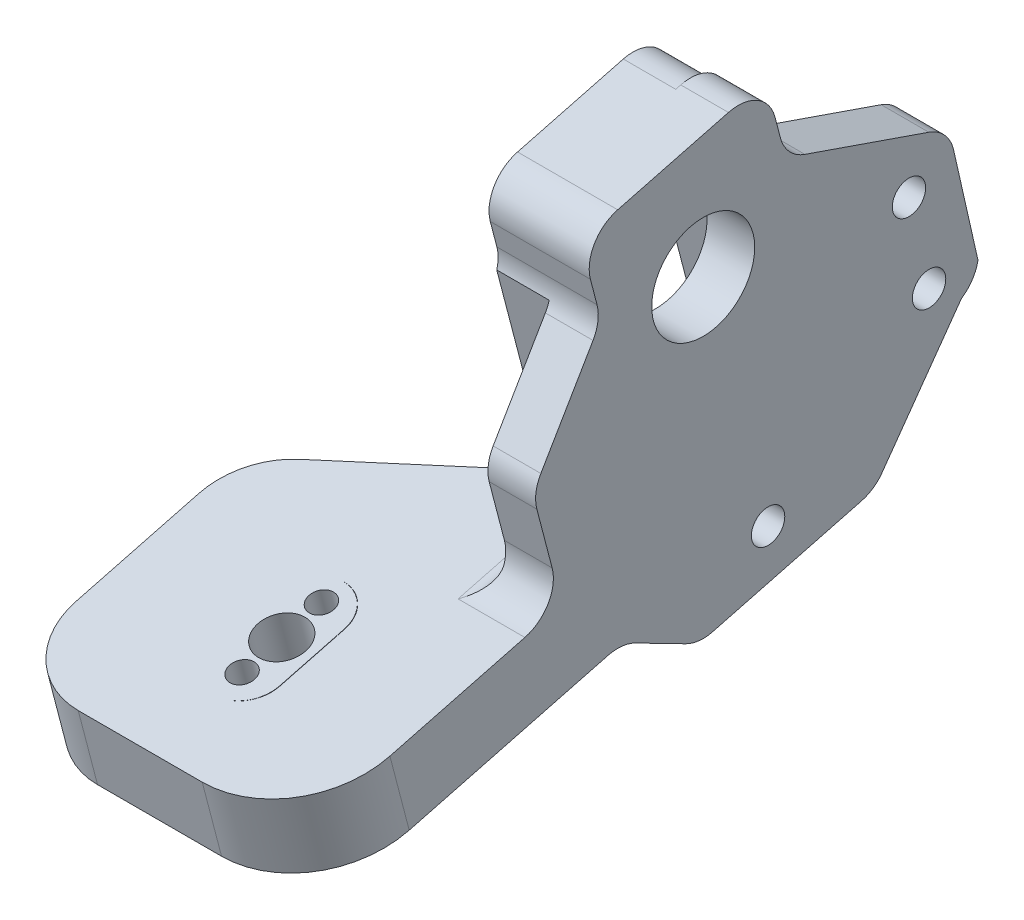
ISO-10303-21;
HEADER;
FILE_DESCRIPTION(('STEP AP214'),'2;1');
FILE_NAME('part.step','',(''),(''),'','','');
FILE_SCHEMA(('AUTOMOTIVE_DESIGN { 1 0 10303 214 1 1 1 1 }'));
ENDSEC;
DATA;
#1=APPLICATION_CONTEXT('core data for automotive mechanical design processes');
#2=APPLICATION_PROTOCOL_DEFINITION('international standard','automotive_design',2000,#1);
#3=PRODUCT_CONTEXT('',#1,'mechanical');
#4=PRODUCT('Part','Part','',(#3));
#5=PRODUCT_RELATED_PRODUCT_CATEGORY('part','',(#4));
#6=PRODUCT_DEFINITION_FORMATION('','',#4);
#7=PRODUCT_DEFINITION_CONTEXT('part definition',#1,'design');
#8=PRODUCT_DEFINITION('design','',#6,#7);
#9=PRODUCT_DEFINITION_SHAPE('','',#8);
#10=(LENGTH_UNIT() NAMED_UNIT(*) SI_UNIT(.MILLI.,.METRE.));
#11=(NAMED_UNIT(*) PLANE_ANGLE_UNIT() SI_UNIT($,.RADIAN.));
#12=(NAMED_UNIT(*) SI_UNIT($,.STERADIAN.) SOLID_ANGLE_UNIT());
#13=UNCERTAINTY_MEASURE_WITH_UNIT(LENGTH_MEASURE(1.E-05),#10,'distance_accuracy_value','');
#14=(GEOMETRIC_REPRESENTATION_CONTEXT(3) GLOBAL_UNCERTAINTY_ASSIGNED_CONTEXT((#13)) GLOBAL_UNIT_ASSIGNED_CONTEXT((#10,
#11,#12)) REPRESENTATION_CONTEXT('',''));
#15=CARTESIAN_POINT('',(0.,0.,0.));
#16=DIRECTION('',(0.,0.,1.));
#17=DIRECTION('',(1.,0.,0.));
#18=AXIS2_PLACEMENT_3D('',#15,#16,#17);
#19=CARTESIAN_POINT('',(-5.,-8.82947833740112,16.0225879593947));
#20=DIRECTION('',(1.,0.,0.));
#21=DIRECTION('',(0.,0.,-1.));
#22=AXIS2_PLACEMENT_3D('',#19,#20,#21);
#23=PLANE('',#22);
#24=CARTESIAN_POINT('',(-5.,7.12356224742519,-25.2542618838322));
#25=DIRECTION('',(1.,0.,0.));
#26=DIRECTION('',(0.,0.,-1.));
#27=AXIS2_PLACEMENT_3D('',#24,#25,#26);
#28=CIRCLE('',#27,1.75);
#29=CARTESIAN_POINT('',(-5.,7.12356224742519,-27.0042618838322));
#30=VERTEX_POINT('',#29);
#31=EDGE_CURVE('E701',#30,#30,#28,.T.);
#32=ORIENTED_EDGE('',*,*,#31,.T.);
#33=EDGE_LOOP('',(#32));
#34=FACE_BOUND('',#33,.T.);
#35=CARTESIAN_POINT('',(-5.,-2.21574772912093,-27.3632896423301));
#36=DIRECTION('',(1.,0.,0.));
#37=DIRECTION('',(0.,0.,-1.));
#38=AXIS2_PLACEMENT_3D('',#35,#36,#37);
#39=CIRCLE('',#38,1.75);
#40=CARTESIAN_POINT('',(-5.,-2.21574772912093,-29.1132896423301));
#41=VERTEX_POINT('',#40);
#42=EDGE_CURVE('E693',#41,#41,#39,.T.);
#43=ORIENTED_EDGE('',*,*,#42,.T.);
#44=EDGE_LOOP('',(#43));
#45=FACE_BOUND('',#44,.T.);
#46=CARTESIAN_POINT('',(-5.,-15.3399742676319,-10.484268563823));
#47=DIRECTION('',(1.,0.,0.));
#48=DIRECTION('',(0.,0.,-1.));
#49=AXIS2_PLACEMENT_3D('',#46,#47,#48);
#50=CIRCLE('',#49,1.75);
#51=CARTESIAN_POINT('',(-5.,-15.3399742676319,-12.234268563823));
#52=VERTEX_POINT('',#51);
#53=EDGE_CURVE('E685',#52,#52,#50,.T.);
#54=ORIENTED_EDGE('',*,*,#53,.T.);
#55=EDGE_LOOP('',(#54));
#56=FACE_BOUND('',#55,.T.);
#57=DIRECTION('',(0.,-0.252801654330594,0.967518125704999));
#58=VECTOR('',#57,1.);
#59=CARTESIAN_POINT('',(-5.,-17.0373330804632,-0.0324959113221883));
#60=LINE('',#59,#58);
#61=CARTESIAN_POINT('',(-5.,-17.0373330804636,-0.0324959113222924));
#62=VERTEX_POINT('',#61);
#63=CARTESIAN_POINT('',(-5.,-18.6841724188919,6.27025916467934));
#64=VERTEX_POINT('',#63);
#65=EDGE_CURVE('E486',#62,#64,#60,.T.);
#66=ORIENTED_EDGE('',*,*,#65,.F.);
#67=CARTESIAN_POINT('',(-5.,-16.6180781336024,-4.01046339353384));
#68=DIRECTION('',(1.,0.,0.));
#69=DIRECTION('',(0.,0.,-1.));
#70=AXIS2_PLACEMENT_3D('',#67,#68,#69);
#71=CIRCLE('',#70,4.00000000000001);
#72=CARTESIAN_POINT('',(-5.,-12.7480056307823,-2.99925677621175));
#73=VERTEX_POINT('',#72);
#74=EDGE_CURVE('E668',#73,#62,#71,.T.);
#75=ORIENTED_EDGE('',*,*,#74,.F.);
#76=DIRECTION('',(0.,0.252801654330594,-0.967518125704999));
#77=VECTOR('',#76,1.);
#78=CARTESIAN_POINT('',(-5.,-17.1501342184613,13.8484937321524));
#79=LINE('',#78,#77);
#80=CARTESIAN_POINT('',(-5.,-9.70294498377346,-14.6532602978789));
#81=VERTEX_POINT('',#80);
#82=EDGE_CURVE('E672',#73,#81,#79,.T.);
#83=ORIENTED_EDGE('',*,*,#82,.T.);
#84=CARTESIAN_POINT('',(-5.,-5.83287248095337,-13.6420536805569));
#85=DIRECTION('',(1.,0.,0.));
#86=DIRECTION('',(0.,0.,-1.));
#87=AXIS2_PLACEMENT_3D('',#84,#85,#86);
#88=CIRCLE('',#87,4.);
#89=CARTESIAN_POINT('',(-5.,-4.82166586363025,-17.5121261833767));
#90=VERTEX_POINT('',#89);
#91=EDGE_CURVE('E676',#81,#90,#88,.T.);
#92=ORIENTED_EDGE('',*,*,#91,.T.);
#93=DIRECTION('',(0.,0.967518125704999,0.252801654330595));
#94=VECTOR('',#93,1.);
#95=CARTESIAN_POINT('',(-5.,-0.371082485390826,-16.3492385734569));
#96=LINE('',#95,#94);
#97=CARTESIAN_POINT('',(-5.,21.3013235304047,-10.6864815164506));
#98=VERTEX_POINT('',#97);
#99=EDGE_CURVE('E680',#90,#98,#96,.T.);
#100=ORIENTED_EDGE('',*,*,#99,.T.);
#101=CARTESIAN_POINT('',(-5.,20.2901169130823,-6.81640901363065));
#102=DIRECTION('',(1.,0.,0.));
#103=DIRECTION('',(0.,0.,-1.));
#104=AXIS2_PLACEMENT_3D('',#101,#102,#103);
#105=CIRCLE('',#104,4.);
#106=CARTESIAN_POINT('',(-5.,24.1601894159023,-5.80520239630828));
#107=VERTEX_POINT('',#106);
#108=EDGE_CURVE('E606',#98,#107,#105,.T.);
#109=ORIENTED_EDGE('',*,*,#108,.T.);
#110=DIRECTION('',(0.,-0.252801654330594,0.967518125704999));
#111=VECTOR('',#110,1.);
#112=CARTESIAN_POINT('',(-5.,24.2970498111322,-6.32899213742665));
#113=LINE('',#112,#111);
#114=CARTESIAN_POINT('',(-5.,24.2970498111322,-6.32899213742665));
#115=VERTEX_POINT('',#114);
#116=EDGE_CURVE('E770',#115,#107,#113,.T.);
#117=ORIENTED_EDGE('',*,*,#116,.F.);
#118=CARTESIAN_POINT('',(-5.,20.4269773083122,-7.34019875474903));
#119=DIRECTION('',(1.,0.,0.));
#120=DIRECTION('',(0.,0.,-1.));
#121=AXIS2_PLACEMENT_3D('',#118,#119,#120);
#122=CIRCLE('',#121,4.);
#123=CARTESIAN_POINT('',(-5.,21.4381839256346,-11.210271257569));
#124=VERTEX_POINT('',#123);
#125=EDGE_CURVE('E766',#124,#115,#122,.T.);
#126=ORIENTED_EDGE('',*,*,#125,.F.);
#127=DIRECTION('',(0.,0.967518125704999,0.252801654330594));
#128=VECTOR('',#127,1.);
#129=CARTESIAN_POINT('',(-5.,19.2523041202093,-11.781417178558));
#130=LINE('',#129,#128);
#131=CARTESIAN_POINT('',(-5.,19.2523041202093,-11.781417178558));
#132=VERTEX_POINT('',#131);
#133=EDGE_CURVE('E762',#132,#124,#130,.T.);
#134=ORIENTED_EDGE('',*,*,#133,.F.);
#135=CARTESIAN_POINT('',(-5.,20.2635107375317,-15.651489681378));
#136=DIRECTION('',(-1.,0.,0.));
#137=DIRECTION('',(0.,0.,-1.));
#138=AXIS2_PLACEMENT_3D('',#135,#136,#137);
#139=CIRCLE('',#138,4.00000000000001);
#140=CARTESIAN_POINT('',(-5.,16.4824992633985,-14.3461344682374));
#141=VERTEX_POINT('',#140);
#142=EDGE_CURVE('E758',#141,#132,#139,.T.);
#143=ORIENTED_EDGE('',*,*,#142,.F.);
#144=DIRECTION('',(0.,0.326338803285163,0.945252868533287));
#145=VECTOR('',#144,1.);
#146=CARTESIAN_POINT('',(-5.,11.9965526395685,-27.3398510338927));
#147=LINE('',#146,#145);
#148=CARTESIAN_POINT('',(-5.,11.9965526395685,-27.3398510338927));
#149=VERTEX_POINT('',#148);
#150=EDGE_CURVE('E754',#149,#141,#147,.T.);
#151=ORIENTED_EDGE('',*,*,#150,.F.);
#152=CARTESIAN_POINT('',(-5.,8.21554116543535,-26.034495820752));
#153=DIRECTION('',(1.,0.,0.));
#154=DIRECTION('',(0.,0.,-1.));
#155=AXIS2_PLACEMENT_3D('',#152,#153,#154);
#156=CIRCLE('',#155,4.00000000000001);
#157=CARTESIAN_POINT('',(-5.,9.22674778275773,-29.904568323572));
#158=VERTEX_POINT('',#157);
#159=EDGE_CURVE('E750',#158,#149,#156,.T.);
#160=ORIENTED_EDGE('',*,*,#159,.F.);
#161=DIRECTION('',(0.,0.975301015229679,0.220879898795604));
#162=VECTOR('',#161,1.);
#163=CARTESIAN_POINT('',(-5.,-2.20234635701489,-32.4929560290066));
#164=LINE('',#163,#162);
#165=CARTESIAN_POINT('',(-5.,-2.20234635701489,-32.4929560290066));
#166=VERTEX_POINT('',#165);
#167=EDGE_CURVE('E746',#166,#158,#164,.T.);
#168=ORIENTED_EDGE('',*,*,#167,.F.);
#169=CARTESIAN_POINT('',(-5.,-1.45964009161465,-28.562512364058));
#170=DIRECTION('',(1.,0.,0.));
#171=DIRECTION('',(0.,0.,-1.));
#172=AXIS2_PLACEMENT_3D('',#169,#170,#171);
#173=CIRCLE('',#172,4.);
#174=CARTESIAN_POINT('',(-5.,-4.80264387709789,-30.7589471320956));
#175=VERTEX_POINT('',#174);
#176=EDGE_CURVE('E742',#175,#166,#173,.T.);
#177=ORIENTED_EDGE('',*,*,#176,.F.);
#178=DIRECTION('',(0.,0.813726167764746,-0.581248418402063));
#179=VECTOR('',#178,1.);
#180=CARTESIAN_POINT('',(-5.,-16.7448230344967,-22.2285925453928));
#181=LINE('',#180,#179);
#182=CARTESIAN_POINT('',(-5.,-16.7448230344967,-22.2285925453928));
#183=VERTEX_POINT('',#182);
#184=EDGE_CURVE('E738',#183,#175,#181,.T.);
#185=ORIENTED_EDGE('',*,*,#184,.F.);
#186=CARTESIAN_POINT('',(-5.,-14.0856445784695,-19.2404878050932));
#187=DIRECTION('',(1.,0.,0.));
#188=DIRECTION('',(0.,0.,-1.));
#189=AXIS2_PLACEMENT_3D('',#186,#187,#188);
#190=CIRCLE('',#189,4.00000000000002);
#191=CARTESIAN_POINT('',(-5.,-17.9557170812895,-20.2516944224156));
#192=VERTEX_POINT('',#191);
#193=EDGE_CURVE('E734',#192,#183,#190,.T.);
#194=ORIENTED_EDGE('',*,*,#193,.F.);
#195=DIRECTION('',(0.,0.252801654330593,-0.967518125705));
#196=VECTOR('',#195,1.);
#197=CARTESIAN_POINT('',(-5.,-17.9557170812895,-20.2516944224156));
#198=LINE('',#197,#196);
#199=CARTESIAN_POINT('',(-5.,-22.0209430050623,-4.69333197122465));
#200=VERTEX_POINT('',#199);
#201=EDGE_CURVE('E730',#200,#192,#198,.T.);
#202=ORIENTED_EDGE('',*,*,#201,.F.);
#203=CARTESIAN_POINT('',(-5.,-18.1508705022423,-3.68212535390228));
#204=DIRECTION('',(1.,0.,0.));
#205=DIRECTION('',(0.,0.,-1.));
#206=AXIS2_PLACEMENT_3D('',#203,#204,#205);
#207=CIRCLE('',#206,3.99999999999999);
#208=CARTESIAN_POINT('',(-5.,-21.70958997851,-1.85578593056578));
#209=VERTEX_POINT('',#208);
#210=EDGE_CURVE('E726',#209,#200,#207,.T.);
#211=ORIENTED_EDGE('',*,*,#210,.F.);
#212=DIRECTION('',(0.,-0.456584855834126,-0.889679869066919));
#213=VECTOR('',#212,1.);
#214=CARTESIAN_POINT('',(-5.,-21.70958997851,-1.85578593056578));
#215=LINE('',#214,#213);
#216=CARTESIAN_POINT('',(-5.,-18.9955254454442,3.43271312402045));
#217=VERTEX_POINT('',#216);
#218=EDGE_CURVE('E721',#217,#209,#215,.T.);
#219=ORIENTED_EDGE('',*,*,#218,.F.);
#220=CARTESIAN_POINT('',(-5.,-22.5542449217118,5.25905254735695));
#221=DIRECTION('',(-1.,0.,0.));
#222=DIRECTION('',(0.,0.,-1.));
#223=AXIS2_PLACEMENT_3D('',#220,#221,#222);
#224=CIRCLE('',#223,4.);
#225=EDGE_CURVE('E717',#64,#217,#224,.T.);
#226=ORIENTED_EDGE('',*,*,#225,.F.);
#227=EDGE_LOOP('',(#66,#75,#83,#92,#100,#109,#117,#126,#134,#143,#151,#160,#168,#177,#185,#194,
#202,#211,#219,#226));
#228=FACE_BOUND('',#227,.T.);
#229=ADVANCED_FACE('F91',(#34,#45,#56,#228),#23,.F.);
#230=CARTESIAN_POINT('',(-5.,10.6862633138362,-3.68390406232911));
#231=DIRECTION('',(1.,0.,0.));
#232=DIRECTION('',(0.,0.,-1.));
#233=AXIS2_PLACEMENT_3D('',#230,#231,#232);
#234=CIRCLE('',#233,5.4);
#235=CARTESIAN_POINT('',(-5.,10.6862633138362,-9.08390406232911));
#236=VERTEX_POINT('',#235);
#237=EDGE_CURVE('E709',#236,#236,#234,.T.);
#238=ORIENTED_EDGE('',*,*,#237,.T.);
#239=EDGE_LOOP('',(#238));
#240=FACE_BOUND('',#239,.T.);
#241=DIRECTION('',(0.,0.967518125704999,0.252801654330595));
#242=VECTOR('',#241,1.);
#243=CARTESIAN_POINT('',(-5.,-1.25588827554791,-12.9629251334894));
#244=LINE('',#243,#242);
#245=CARTESIAN_POINT('',(-5.,-3.77143540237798,-13.6202094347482));
#246=VERTEX_POINT('',#245);
#247=CARTESIAN_POINT('',(-5.,18.481481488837,-7.80577138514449));
#248=VERTEX_POINT('',#247);
#249=EDGE_CURVE('E660',#246,#248,#244,.T.);
#250=ORIENTED_EDGE('',*,*,#249,.F.);
#251=DIRECTION('',(0.,0.252801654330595,-0.967518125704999));
#252=VECTOR('',#251,1.);
#253=CARTESIAN_POINT('',(-5.,-11.3450254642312,15.3653036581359));
#254=LINE('',#253,#252);
#255=CARTESIAN_POINT('',(-5.,-7.05785690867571,-1.04247380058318));
#256=VERTEX_POINT('',#255);
#257=EDGE_CURVE('E648',#256,#246,#254,.T.);
#258=ORIENTED_EDGE('',*,*,#257,.F.);
#259=DIRECTION('',(0.,-0.967518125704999,-0.252801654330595));
#260=VECTOR('',#259,1.);
#261=CARTESIAN_POINT('',(-5.,-4.54230978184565,-0.385189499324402));
#262=LINE('',#261,#260);
#263=CARTESIAN_POINT('',(-5.,15.1950599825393,4.77196424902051));
#264=VERTEX_POINT('',#263);
#265=EDGE_CURVE('E652',#264,#256,#262,.T.);
#266=ORIENTED_EDGE('',*,*,#265,.F.);
#267=DIRECTION('',(0.,-0.252801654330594,0.967518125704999));
#268=VECTOR('',#267,1.);
#269=CARTESIAN_POINT('',(-5.,10.9078914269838,21.1797417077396));
#270=LINE('',#269,#268);
#271=EDGE_CURVE('E656',#248,#264,#270,.T.);
#272=ORIENTED_EDGE('',*,*,#271,.F.);
#273=EDGE_LOOP('',(#250,#258,#266,#272));
#274=FACE_BOUND('',#273,.T.);
#275=ADVANCED_FACE('F1087',(#240,#274),#23,.F.);
#276=CARTESIAN_POINT('',(-5.,-17.2499806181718,32.4267076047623));
#277=DIRECTION('',(0.,0.967518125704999,0.252801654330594));
#278=DIRECTION('',(0.,-0.252801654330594,0.967518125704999));
#279=AXIS2_PLACEMENT_3D('',#276,#277,#278);
#280=PLANE('',#279);
#281=CARTESIAN_POINT('',(-15.390320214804,-14.2513402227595,20.9503628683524));
#282=DIRECTION('',(0.,-0.967518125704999,-0.252801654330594));
#283=DIRECTION('',(0.,0.252801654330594,-0.967518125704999));
#284=AXIS2_PLACEMENT_3D('',#281,#282,#283);
#285=CIRCLE('',#284,1.3);
#286=CARTESIAN_POINT('',(-15.390320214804,-13.9226980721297,19.6925893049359));
#287=VERTEX_POINT('',#286);
#288=EDGE_CURVE('E1130',#287,#287,#285,.T.);
#289=ORIENTED_EDGE('',*,*,#288,.T.);
#290=EDGE_LOOP('',(#289));
#291=FACE_BOUND('',#290,.T.);
#292=CARTESIAN_POINT('',(-15.390320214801,-16.4254344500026,29.2710187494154));
#293=DIRECTION('',(0.,-0.967518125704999,-0.252801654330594));
#294=DIRECTION('',(0.,0.252801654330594,-0.967518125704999));
#295=AXIS2_PLACEMENT_3D('',#292,#293,#294);
#296=CIRCLE('',#295,1.3);
#297=CARTESIAN_POINT('',(-15.390320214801,-16.0967922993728,28.0132451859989));
#298=VERTEX_POINT('',#297);
#299=EDGE_CURVE('E1326',#298,#298,#296,.T.);
#300=ORIENTED_EDGE('',*,*,#299,.T.);
#301=EDGE_LOOP('',(#300));
#302=FACE_BOUND('',#301,.T.);
#303=CARTESIAN_POINT('',(-15.390320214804,-15.338387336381,25.1106908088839));
#304=DIRECTION('',(0.,-0.967518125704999,-0.252801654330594));
#305=DIRECTION('',(0.,0.252801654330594,-0.967518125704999));
#306=AXIS2_PLACEMENT_3D('',#303,#304,#305);
#307=CIRCLE('',#306,2.5);
#308=CARTESIAN_POINT('',(-15.390320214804,-14.7063832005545,22.6918954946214));
#309=VERTEX_POINT('',#308);
#310=EDGE_CURVE('E443',#309,#309,#307,.T.);
#311=ORIENTED_EDGE('',*,*,#310,.T.);
#312=EDGE_LOOP('',(#311));
#313=FACE_BOUND('',#312,.T.);
#314=CARTESIAN_POINT('',(-15.5,-16.2703234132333,28.6773804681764));
#315=DIRECTION('',(0.,-0.967518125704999,-0.252801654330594));
#316=DIRECTION('',(0.,0.252801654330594,-0.967518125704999));
#317=AXIS2_PLACEMENT_3D('',#314,#315,#316);
#318=CIRCLE('',#317,3.5);
#319=CARTESIAN_POINT('',(-12.,-16.2703234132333,28.6773804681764));
#320=VERTEX_POINT('',#319);
#321=CARTESIAN_POINT('',(-14.7656162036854,-17.1354327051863,31.9883118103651));
#322=VERTEX_POINT('',#321);
#323=EDGE_CURVE('E466',#320,#322,#318,.T.);
#324=ORIENTED_EDGE('',*,*,#323,.T.);
#325=CARTESIAN_POINT('',(-15.5315192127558,-16.2720718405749,28.6840720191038));
#326=DIRECTION('',(0.,-0.967518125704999,-0.252801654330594));
#327=DIRECTION('',(0.,0.252801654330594,-0.967518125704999));
#328=AXIS2_PLACEMENT_3D('',#325,#326,#327);
#329=CIRCLE('',#328,3.5);
#330=CARTESIAN_POINT('',(-12.0315192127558,-16.2720718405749,28.6840720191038));
#331=VERTEX_POINT('',#330);
#332=EDGE_CURVE('E422',#331,#322,#329,.T.);
#333=ORIENTED_EDGE('',*,*,#332,.F.);
#334=DIRECTION('',(0.,-0.252801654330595,0.967518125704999));
#335=VECTOR('',#334,1.);
#336=CARTESIAN_POINT('',(-12.0315192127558,-16.2720718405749,28.6840720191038));
#337=LINE('',#336,#335);
#338=CARTESIAN_POINT('',(-12.0315192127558,-14.5024602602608,21.9114451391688));
#339=VERTEX_POINT('',#338);
#340=EDGE_CURVE('E421',#339,#331,#337,.T.);
#341=ORIENTED_EDGE('',*,*,#340,.F.);
#342=CARTESIAN_POINT('',(-15.5315192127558,-14.5024602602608,21.9114451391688));
#343=DIRECTION('',(0.,-0.967518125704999,-0.252801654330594));
#344=DIRECTION('',(0.,0.252801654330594,-0.967518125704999));
#345=AXIS2_PLACEMENT_3D('',#342,#343,#344);
#346=CIRCLE('',#345,3.5);
#347=CARTESIAN_POINT('',(-16.2659030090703,-13.6373509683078,18.6005137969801));
#348=VERTEX_POINT('',#347);
#349=EDGE_CURVE('E409',#348,#339,#346,.T.);
#350=ORIENTED_EDGE('',*,*,#349,.F.);
#351=CARTESIAN_POINT('',(-15.5,-14.5007118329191,21.9047535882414));
#352=DIRECTION('',(0.,-0.967518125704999,-0.252801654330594));
#353=DIRECTION('',(0.,0.252801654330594,-0.967518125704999));
#354=AXIS2_PLACEMENT_3D('',#351,#352,#353);
#355=CIRCLE('',#354,3.5);
#356=CARTESIAN_POINT('',(-12.,-14.5007118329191,21.9047535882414));
#357=VERTEX_POINT('',#356);
#358=EDGE_CURVE('E458',#348,#357,#355,.T.);
#359=ORIENTED_EDGE('',*,*,#358,.T.);
#360=DIRECTION('',(0.,-0.252801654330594,0.967518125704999));
#361=VECTOR('',#360,1.);
#362=CARTESIAN_POINT('',(-12.,-14.5007118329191,21.9047535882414));
#363=LINE('',#362,#361);
#364=EDGE_CURVE('E461',#357,#320,#363,.T.);
#365=ORIENTED_EDGE('',*,*,#364,.T.);
#366=EDGE_LOOP('',(#324,#333,#341,#350,#359,#365));
#367=FACE_BOUND('',#366,.T.);
#368=DIRECTION('',(1.,0.,0.));
#369=VECTOR('',#368,1.);
#370=CARTESIAN_POINT('',(-5.,-12.6995508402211,15.0113813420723));
#371=LINE('',#370,#369);
#372=CARTESIAN_POINT('',(-7.,-12.6995508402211,15.0113813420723));
#373=VERTEX_POINT('',#372);
#374=CARTESIAN_POINT('',(0.,-12.6995508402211,15.0113813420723));
#375=VERTEX_POINT('',#374);
#376=EDGE_CURVE('E116',#373,#375,#371,.T.);
#377=ORIENTED_EDGE('',*,*,#376,.F.);
#378=DIRECTION('',(0.,-0.252801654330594,0.967518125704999));
#379=VECTOR('',#378,1.);
#380=CARTESIAN_POINT('',(-7.,-17.2499806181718,32.4267076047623));
#381=LINE('',#380,#379);
#382=CARTESIAN_POINT('',(-7.,-9.80279138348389,3.92495357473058));
#383=VERTEX_POINT('',#382);
#384=EDGE_CURVE('E978',#373,#383,#381,.F.);
#385=ORIENTED_EDGE('',*,*,#384,.T.);
#386=DIRECTION('',(1.,0.,0.));
#387=VECTOR('',#386,1.);
#388=CARTESIAN_POINT('',(-10.5,-9.80279138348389,3.92495357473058));
#389=LINE('',#388,#387);
#390=CARTESIAN_POINT('',(-13.8555944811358,-9.80279138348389,3.92495357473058));
#391=VERTEX_POINT('',#390);
#392=EDGE_CURVE('E975',#383,#391,#389,.F.);
#393=ORIENTED_EDGE('',*,*,#392,.T.);
#394=DIRECTION('',(-0.858997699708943,-0.129429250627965,0.495349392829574));
#395=VECTOR('',#394,1.);
#396=CARTESIAN_POINT('',(-10.5,-9.29718807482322,1.98991732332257));
#397=LINE('',#396,#395);
#398=CARTESIAN_POINT('',(-27.0958355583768,-11.7977611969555,11.5600675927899));
#399=VERTEX_POINT('',#398);
#400=EDGE_CURVE('E496',#391,#399,#397,.T.);
#401=ORIENTED_EDGE('',*,*,#400,.T.);
#402=CARTESIAN_POINT('',(-23.,-13.5350095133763,18.2088343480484));
#403=DIRECTION('',(0.,0.967518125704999,0.252801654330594));
#404=DIRECTION('',(0.,-0.252801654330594,0.967518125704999));
#405=AXIS2_PLACEMENT_3D('',#402,#403,#404);
#406=CIRCLE('',#405,8.);
#407=CARTESIAN_POINT('',(-31.,-13.5350095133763,18.2088343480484));
#408=VERTEX_POINT('',#407);
#409=EDGE_CURVE('E499',#399,#408,#406,.T.);
#410=ORIENTED_EDGE('',*,*,#409,.T.);
#411=DIRECTION('',(0.,-0.252801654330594,0.967518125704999));
#412=VECTOR('',#411,1.);
#413=CARTESIAN_POINT('',(-31.,-13.5350095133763,18.2088343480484));
#414=LINE('',#413,#412);
#415=CARTESIAN_POINT('',(-31.,-16.9023275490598,31.0961757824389));
#416=VERTEX_POINT('',#415);
#417=EDGE_CURVE('E503',#408,#416,#414,.T.);
#418=ORIENTED_EDGE('',*,*,#417,.T.);
#419=CARTESIAN_POINT('',(-23.,-16.9023275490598,31.0961757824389));
#420=DIRECTION('',(0.,0.967518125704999,0.252801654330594));
#421=DIRECTION('',(0.,-0.252801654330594,0.967518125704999));
#422=AXIS2_PLACEMENT_3D('',#419,#420,#421);
#423=CIRCLE('',#422,8.);
#424=CARTESIAN_POINT('',(-23.,-18.9247407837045,38.8363207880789));
#425=VERTEX_POINT('',#424);
#426=EDGE_CURVE('E506',#416,#425,#423,.T.);
#427=ORIENTED_EDGE('',*,*,#426,.T.);
#428=DIRECTION('',(1.,0.,0.));
#429=VECTOR('',#428,1.);
#430=CARTESIAN_POINT('',(-23.,-18.9247407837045,38.8363207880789));
#431=LINE('',#430,#429);
#432=CARTESIAN_POINT('',(-10.,-18.9247407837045,38.8363207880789));
#433=VERTEX_POINT('',#432);
#434=EDGE_CURVE('E509',#425,#433,#431,.T.);
#435=ORIENTED_EDGE('',*,*,#434,.T.);
#436=CARTESIAN_POINT('',(-10.,-16.3967242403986,29.1611395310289));
#437=DIRECTION('',(0.,0.967518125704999,0.252801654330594));
#438=DIRECTION('',(0.,-0.252801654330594,0.967518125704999));
#439=AXIS2_PLACEMENT_3D('',#436,#437,#438);
#440=CIRCLE('',#439,10.);
#441=CARTESIAN_POINT('',(0.,-16.3967242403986,29.1611395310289));
#442=VERTEX_POINT('',#441);
#443=EDGE_CURVE('E968',#433,#442,#440,.T.);
#444=ORIENTED_EDGE('',*,*,#443,.T.);
#445=DIRECTION('',(0.,-0.252801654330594,0.967518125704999));
#446=VECTOR('',#445,1.);
#447=CARTESIAN_POINT('',(0.,-17.2499806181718,32.4267076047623));
#448=LINE('',#447,#446);
#449=EDGE_CURVE('E713',#375,#442,#448,.T.);
#450=ORIENTED_EDGE('',*,*,#449,.F.);
#451=EDGE_LOOP('',(#377,#385,#393,#401,#410,#418,#427,#435,#444,#450));
#452=FACE_BOUND('',#451,.T.);
#453=ADVANCED_FACE('F434',(#291,#302,#313,#367,#452),#280,.T.);
#454=CARTESIAN_POINT('',(-5.,-8.82947833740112,16.0225879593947));
#455=DIRECTION('',(1.,0.,0.));
#456=DIRECTION('',(0.,0.,-1.));
#457=AXIS2_PLACEMENT_3D('',#454,#455,#456);
#458=CYLINDRICAL_SURFACE('',#457,4.00000000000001);
#459=CARTESIAN_POINT('',(0.,-8.82947833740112,16.0225879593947));
#460=DIRECTION('',(-1.,0.,0.));
#461=DIRECTION('',(0.,0.,-1.));
#462=AXIS2_PLACEMENT_3D('',#459,#460,#461);
#463=CIRCLE('',#462,4.00000000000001);
#464=CARTESIAN_POINT('',(0.,-7.81827172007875,12.1525154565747));
#465=VERTEX_POINT('',#464);
#466=EDGE_CURVE('E722',#465,#375,#463,.T.);
#467=ORIENTED_EDGE('',*,*,#466,.F.);
#468=DIRECTION('',(1.,0.,0.));
#469=VECTOR('',#468,1.);
#470=CARTESIAN_POINT('',(-5.,-7.81827172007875,12.1525154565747));
#471=LINE('',#470,#469);
#472=CARTESIAN_POINT('',(-5.,-7.81827172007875,12.1525154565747));
#473=VERTEX_POINT('',#472);
#474=EDGE_CURVE('E884',#473,#465,#471,.T.);
#475=ORIENTED_EDGE('',*,*,#474,.F.);
#476=CARTESIAN_POINT('',(-5.,-8.82947833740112,16.0225879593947));
#477=DIRECTION('',(-1.,0.,0.));
#478=DIRECTION('',(0.,0.,-1.));
#479=AXIS2_PLACEMENT_3D('',#476,#477,#478);
#480=CIRCLE('',#479,4.00000000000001);
#481=CARTESIAN_POINT('',(-5.,-9.88878396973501,12.1654035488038));
#482=VERTEX_POINT('',#481);
#483=EDGE_CURVE('E789',#473,#482,#480,.T.);
#484=ORIENTED_EDGE('',*,*,#483,.T.);
#485=CARTESIAN_POINT('',(-5.,-9.88878396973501,12.1654035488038));
#486=CARTESIAN_POINT('',(-4.99999947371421,-9.97219566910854,12.1882830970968));
#487=CARTESIAN_POINT('',(-5.00420631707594,-10.0547540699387,12.2138919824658));
#488=CARTESIAN_POINT('',(-5.0200268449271,-10.2172221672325,12.2700585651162));
#489=CARTESIAN_POINT('',(-5.03162176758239,-10.2971380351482,12.3006035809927));
#490=CARTESIAN_POINT('',(-5.06102453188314,-10.4527706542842,12.3658179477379));
#491=CARTESIAN_POINT('',(-5.07874803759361,-10.5285290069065,12.4004273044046));
#492=CARTESIAN_POINT('',(-5.11957089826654,-10.6766257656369,12.4736622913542));
#493=CARTESIAN_POINT('',(-5.14267420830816,-10.7489616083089,12.5122908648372));
#494=CARTESIAN_POINT('',(-5.19829435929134,-10.9033225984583,12.6008165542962));
#495=CARTESIAN_POINT('',(-5.23176580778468,-10.9845755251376,12.651459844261));
#496=CARTESIAN_POINT('',(-5.30404401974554,-11.1415969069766,12.7571519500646));
#497=CARTESIAN_POINT('',(-5.3428508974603,-11.2173652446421,12.81220086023));
#498=CARTESIAN_POINT('',(-5.46629847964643,-11.4372359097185,12.9837921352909));
#499=CARTESIAN_POINT('',(-5.55763890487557,-11.5730498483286,13.1062790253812));
#500=CARTESIAN_POINT('',(-5.7231080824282,-11.7856437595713,13.3250028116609));
#501=CARTESIAN_POINT('',(-5.79429808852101,-11.8679805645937,13.4182395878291));
#502=CARTESIAN_POINT('',(-5.94106491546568,-12.0222249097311,13.6098118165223));
#503=CARTESIAN_POINT('',(-6.01664368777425,-12.0941277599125,13.7081495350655));
#504=CARTESIAN_POINT('',(-6.24783994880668,-12.2942859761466,14.0093389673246));
#505=CARTESIAN_POINT('',(-6.40826489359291,-12.4074188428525,14.2188172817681));
#506=CARTESIAN_POINT('',(-6.64074973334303,-12.5406610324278,14.5268484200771));
#507=CARTESIAN_POINT('',(-6.71087731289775,-12.5769688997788,14.6203280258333));
#508=CARTESIAN_POINT('',(-6.85157480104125,-12.6423615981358,14.8093655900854));
#509=CARTESIAN_POINT('',(-6.9221441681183,-12.6714539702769,14.9049212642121));
#510=CARTESIAN_POINT('',(-6.99513138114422,-12.6978059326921,15.0047208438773));
#511=CARTESIAN_POINT('',(-6.99756570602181,-12.6986805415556,15.0080505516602));
#512=CARTESIAN_POINT('',(-7.,-12.6995508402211,15.0113813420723));
#513=B_SPLINE_CURVE_WITH_KNOTS('',3,(#485,#486,#487,#488,#489,#490,#491,#492,#493,#494,#495,
#496,#497,#498,#499,#500,#501,#502,#503,#504,#505,#506,#507,#508,#509,#510,#511,#512),
.UNSPECIFIED.,.F.,.F.,(4,2,2,2,2,2,2,2,2,2,2,2,2,4),(0.,0.259184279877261,0.517712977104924,
0.772816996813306,1.02810915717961,1.33193356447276,1.63576447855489,2.24651638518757,
2.67598110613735,3.1056382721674,3.96284212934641,4.32982765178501,4.69642799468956,
4.70907711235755),.UNSPECIFIED.);
#514=EDGE_CURVE('E101',#482,#373,#513,.T.);
#515=ORIENTED_EDGE('',*,*,#514,.T.);
#516=ORIENTED_EDGE('',*,*,#376,.T.);
#517=EDGE_LOOP('',(#467,#475,#484,#515,#516));
#518=FACE_BOUND('',#517,.T.);
#519=ADVANCED_FACE('F993',(#518),#458,.F.);
#520=CARTESIAN_POINT('',(-5.,-7.81827172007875,12.1525154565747));
#521=DIRECTION('',(0.,-0.252801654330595,0.967518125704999));
#522=DIRECTION('',(0.,-0.967518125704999,-0.252801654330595));
#523=AXIS2_PLACEMENT_3D('',#520,#521,#522);
#524=PLANE('',#523);
#525=DIRECTION('',(0.,-0.967518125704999,-0.252801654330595));
#526=VECTOR('',#525,1.);
#527=CARTESIAN_POINT('',(0.,-7.81827172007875,12.1525154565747));
#528=LINE('',#527,#526);
#529=CARTESIAN_POINT('',(0.,-1.68116323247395,13.7560731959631));
#530=VERTEX_POINT('',#529);
#531=EDGE_CURVE('E874',#530,#465,#528,.T.);
#532=ORIENTED_EDGE('',*,*,#531,.F.);
#533=DIRECTION('',(1.,0.,0.));
#534=VECTOR('',#533,1.);
#535=CARTESIAN_POINT('',(-5.,-1.68116323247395,13.7560731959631));
#536=LINE('',#535,#534);
#537=CARTESIAN_POINT('',(-5.,-1.68116323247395,13.7560731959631));
#538=VERTEX_POINT('',#537);
#539=EDGE_CURVE('E887',#538,#530,#536,.T.);
#540=ORIENTED_EDGE('',*,*,#539,.F.);
#541=DIRECTION('',(0.,-0.967518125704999,-0.252801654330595));
#542=VECTOR('',#541,1.);
#543=CARTESIAN_POINT('',(-5.,-7.81827172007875,12.1525154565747));
#544=LINE('',#543,#542);
#545=EDGE_CURVE('E785',#538,#473,#544,.T.);
#546=ORIENTED_EDGE('',*,*,#545,.T.);
#547=ORIENTED_EDGE('',*,*,#474,.T.);
#548=EDGE_LOOP('',(#532,#540,#546,#547));
#549=FACE_BOUND('',#548,.T.);
#550=ADVANCED_FACE('F998',(#549),#524,.T.);
#551=CARTESIAN_POINT('',(-5.,-0.669956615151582,9.88600069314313));
#552=DIRECTION('',(1.,0.,0.));
#553=DIRECTION('',(0.,0.,-1.));
#554=AXIS2_PLACEMENT_3D('',#551,#552,#553);
#555=CYLINDRICAL_SURFACE('',#554,3.99999999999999);
#556=CARTESIAN_POINT('',(0.,-0.669956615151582,9.88600069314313));
#557=DIRECTION('',(1.,0.,0.));
#558=DIRECTION('',(0.,0.,-1.));
#559=AXIS2_PLACEMENT_3D('',#556,#557,#558);
#560=CIRCLE('',#559,3.99999999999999);
#561=CARTESIAN_POINT('',(0.,1.35156683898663,13.3375862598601));
#562=VERTEX_POINT('',#561);
#563=EDGE_CURVE('E870',#562,#530,#560,.T.);
#564=ORIENTED_EDGE('',*,*,#563,.F.);
#565=DIRECTION('',(1.,0.,0.));
#566=VECTOR('',#565,1.);
#567=CARTESIAN_POINT('',(-5.,1.35156683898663,13.3375862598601));
#568=LINE('',#567,#566);
#569=CARTESIAN_POINT('',(-5.,1.35156683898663,13.3375862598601));
#570=VERTEX_POINT('',#569);
#571=EDGE_CURVE('E890',#570,#562,#568,.T.);
#572=ORIENTED_EDGE('',*,*,#571,.F.);
#573=CARTESIAN_POINT('',(-5.,-0.669956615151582,9.88600069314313));
#574=DIRECTION('',(1.,0.,0.));
#575=DIRECTION('',(0.,0.,-1.));
#576=AXIS2_PLACEMENT_3D('',#573,#574,#575);
#577=CIRCLE('',#576,3.99999999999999);
#578=EDGE_CURVE('E781',#570,#538,#577,.T.);
#579=ORIENTED_EDGE('',*,*,#578,.T.);
#580=ORIENTED_EDGE('',*,*,#539,.T.);
#581=EDGE_LOOP('',(#564,#572,#579,#580));
#582=FACE_BOUND('',#581,.T.);
#583=ADVANCED_FACE('F1004',(#582),#555,.T.);
#584=CARTESIAN_POINT('',(-5.,1.35156683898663,13.3375862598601));
#585=DIRECTION('',(0.,0.505380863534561,0.862896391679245));
#586=DIRECTION('',(0.,-0.862896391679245,0.505380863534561));
#587=AXIS2_PLACEMENT_3D('',#584,#585,#586);
#588=PLANE('',#587);
#589=DIRECTION('',(0.,-0.862896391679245,0.505380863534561));
#590=VECTOR('',#589,1.);
#591=CARTESIAN_POINT('',(0.,1.35156683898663,13.3375862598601));
#592=LINE('',#591,#590);
#593=CARTESIAN_POINT('',(0.,10.6953775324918,7.8651064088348));
#594=VERTEX_POINT('',#593);
#595=EDGE_CURVE('E866',#594,#562,#592,.T.);
#596=ORIENTED_EDGE('',*,*,#595,.F.);
#597=DIRECTION('',(1.,0.,0.));
#598=VECTOR('',#597,1.);
#599=CARTESIAN_POINT('',(-5.,10.6953775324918,7.8651064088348));
#600=LINE('',#599,#598);
#601=CARTESIAN_POINT('',(-5.,10.6953775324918,7.8651064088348));
#602=VERTEX_POINT('',#601);
#603=EDGE_CURVE('E893',#602,#594,#600,.T.);
#604=ORIENTED_EDGE('',*,*,#603,.F.);
#605=DIRECTION('',(0.,-0.862896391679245,0.505380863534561));
#606=VECTOR('',#605,1.);
#607=CARTESIAN_POINT('',(-5.,1.35156683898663,13.3375862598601));
#608=LINE('',#607,#606);
#609=EDGE_CURVE('E777',#602,#570,#608,.T.);
#610=ORIENTED_EDGE('',*,*,#609,.T.);
#611=ORIENTED_EDGE('',*,*,#571,.T.);
#612=EDGE_LOOP('',(#596,#604,#610,#611));
#613=FACE_BOUND('',#612,.T.);
#614=ADVANCED_FACE('F1008',(#613),#588,.T.);
#615=CARTESIAN_POINT('',(-5.,12.7169009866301,11.3166919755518));
#616=DIRECTION('',(1.,0.,0.));
#617=DIRECTION('',(0.,0.,-1.));
#618=AXIS2_PLACEMENT_3D('',#615,#616,#617);
#619=CYLINDRICAL_SURFACE('',#618,4.00000000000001);
#620=ORIENTED_EDGE('',*,*,#603,.T.);
#621=CARTESIAN_POINT('',(0.,12.7169009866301,11.3166919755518));
#622=DIRECTION('',(-1.,0.,0.));
#623=DIRECTION('',(0.,0.,-1.));
#624=AXIS2_PLACEMENT_3D('',#621,#622,#623);
#625=CIRCLE('',#624,4.00000000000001);
#626=CARTESIAN_POINT('',(0.,13.7281076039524,7.44661947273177));
#627=VERTEX_POINT('',#626);
#628=EDGE_CURVE('E863',#627,#594,#625,.T.);
#629=ORIENTED_EDGE('',*,*,#628,.F.);
#630=DIRECTION('',(1.,0.,0.));
#631=VECTOR('',#630,1.);
#632=CARTESIAN_POINT('',(-5.,13.7281076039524,7.44661947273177));
#633=LINE('',#632,#631);
#634=CARTESIAN_POINT('',(-10.5,13.7281076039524,7.44661947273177));
#635=VERTEX_POINT('',#634);
#636=EDGE_CURVE('E897',#635,#627,#633,.T.);
#637=ORIENTED_EDGE('',*,*,#636,.F.);
#638=CARTESIAN_POINT('',(-10.5,12.7169009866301,11.3166919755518));
#639=DIRECTION('',(1.,0.,0.));
#640=DIRECTION('',(0.,0.,-1.));
#641=AXIS2_PLACEMENT_3D('',#638,#639,#640);
#642=CIRCLE('',#641,4.00000000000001);
#643=CARTESIAN_POINT('',(-10.5,11.647062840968,7.46241560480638));
#644=VERTEX_POINT('',#643);
#645=EDGE_CURVE('E583',#635,#644,#642,.F.);
#646=ORIENTED_EDGE('',*,*,#645,.T.);
#647=DIRECTION('',(1.,0.,0.));
#648=VECTOR('',#647,1.);
#649=CARTESIAN_POINT('',(-10.5,11.647062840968,7.46241560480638));
#650=LINE('',#649,#648);
#651=CARTESIAN_POINT('',(-5.,11.647062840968,7.46241560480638));
#652=VERTEX_POINT('',#651);
#653=EDGE_CURVE('E619',#644,#652,#650,.T.);
#654=ORIENTED_EDGE('',*,*,#653,.T.);
#655=CARTESIAN_POINT('',(-5.,12.7169009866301,11.3166919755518));
#656=DIRECTION('',(-1.,0.,0.));
#657=DIRECTION('',(0.,0.,-1.));
#658=AXIS2_PLACEMENT_3D('',#655,#656,#657);
#659=CIRCLE('',#658,4.00000000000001);
#660=EDGE_CURVE('E774',#652,#602,#659,.T.);
#661=ORIENTED_EDGE('',*,*,#660,.T.);
#662=EDGE_LOOP('',(#620,#629,#637,#646,#654,#661));
#663=FACE_BOUND('',#662,.T.);
#664=ADVANCED_FACE('F1012',(#663),#619,.F.);
#665=CARTESIAN_POINT('',(-5.,13.7281076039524,7.44661947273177));
#666=DIRECTION('',(0.,-0.252801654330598,0.967518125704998));
#667=DIRECTION('',(0.,-0.967518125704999,-0.252801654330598));
#668=AXIS2_PLACEMENT_3D('',#665,#666,#667);
#669=PLANE('',#668);
#670=DIRECTION('',(0.,-0.967518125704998,-0.252801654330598));
#671=VECTOR('',#670,1.);
#672=CARTESIAN_POINT('',(0.,13.7281076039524,7.44661947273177));
#673=LINE('',#672,#671);
#674=CARTESIAN_POINT('',(0.,16.3821508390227,8.14009125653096));
#675=VERTEX_POINT('',#674);
#676=EDGE_CURVE('E859',#675,#627,#673,.T.);
#677=ORIENTED_EDGE('',*,*,#676,.F.);
#678=DIRECTION('',(1.,0.,0.));
#679=VECTOR('',#678,1.);
#680=CARTESIAN_POINT('',(-5.,16.3821508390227,8.14009125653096));
#681=LINE('',#680,#679);
#682=CARTESIAN_POINT('',(-10.5,16.3821508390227,8.14009125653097));
#683=VERTEX_POINT('',#682);
#684=EDGE_CURVE('E900',#683,#675,#681,.T.);
#685=ORIENTED_EDGE('',*,*,#684,.F.);
#686=DIRECTION('',(0.,-0.967518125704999,-0.252801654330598));
#687=VECTOR('',#686,1.);
#688=CARTESIAN_POINT('',(-10.5,-0.944024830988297,3.61295553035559));
#689=LINE('',#688,#687);
#690=EDGE_CURVE('E579',#683,#635,#689,.T.);
#691=ORIENTED_EDGE('',*,*,#690,.T.);
#692=ORIENTED_EDGE('',*,*,#636,.T.);
#693=EDGE_LOOP('',(#677,#685,#691,#692));
#694=FACE_BOUND('',#693,.T.);
#695=ADVANCED_FACE('F1016',(#694),#669,.T.);
#696=CARTESIAN_POINT('',(-5.,17.3933574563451,4.27001875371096));
#697=DIRECTION('',(1.,0.,0.));
#698=DIRECTION('',(0.,0.,-1.));
#699=AXIS2_PLACEMENT_3D('',#696,#697,#698);
#700=CYLINDRICAL_SURFACE('',#699,4.00000000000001);
#701=CARTESIAN_POINT('',(0.,17.3933574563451,4.27001875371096));
#702=DIRECTION('',(1.,0.,0.));
#703=DIRECTION('',(0.,0.,-1.));
#704=AXIS2_PLACEMENT_3D('',#701,#702,#703);
#705=CIRCLE('',#704,4.00000000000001);
#706=CARTESIAN_POINT('',(0.,21.2634299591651,5.28122537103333));
#707=VERTEX_POINT('',#706);
#708=EDGE_CURVE('E855',#707,#675,#705,.T.);
#709=ORIENTED_EDGE('',*,*,#708,.F.);
#710=DIRECTION('',(1.,0.,0.));
#711=VECTOR('',#710,1.);
#712=CARTESIAN_POINT('',(-5.,21.2634299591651,5.28122537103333));
#713=LINE('',#712,#711);
#714=CARTESIAN_POINT('',(-10.5,21.2634299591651,5.28122537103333));
#715=VERTEX_POINT('',#714);
#716=EDGE_CURVE('E903',#715,#707,#713,.T.);
#717=ORIENTED_EDGE('',*,*,#716,.F.);
#718=CARTESIAN_POINT('',(-10.5,17.3933574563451,4.27001875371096));
#719=DIRECTION('',(1.,0.,0.));
#720=DIRECTION('',(0.,0.,-1.));
#721=AXIS2_PLACEMENT_3D('',#718,#719,#720);
#722=CIRCLE('',#721,4.00000000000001);
#723=EDGE_CURVE('E575',#715,#683,#722,.T.);
#724=ORIENTED_EDGE('',*,*,#723,.T.);
#725=ORIENTED_EDGE('',*,*,#684,.T.);
#726=EDGE_LOOP('',(#709,#717,#724,#725));
#727=FACE_BOUND('',#726,.T.);
#728=ADVANCED_FACE('F1020',(#727),#700,.T.);
#729=CARTESIAN_POINT('',(-5.,24.2970498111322,-6.32899213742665));
#730=DIRECTION('',(0.,0.967518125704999,0.252801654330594));
#731=DIRECTION('',(0.,-0.252801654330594,0.967518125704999));
#732=AXIS2_PLACEMENT_3D('',#729,#730,#731);
#733=PLANE('',#732);
#734=ORIENTED_EDGE('',*,*,#716,.T.);
#735=DIRECTION('',(0.,-0.252801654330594,0.967518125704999));
#736=VECTOR('',#735,1.);
#737=CARTESIAN_POINT('',(0.,24.2970498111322,-6.32899213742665));
#738=LINE('',#737,#736);
#739=CARTESIAN_POINT('',(0.,24.2970498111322,-6.32899213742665));
#740=VERTEX_POINT('',#739);
#741=EDGE_CURVE('E852',#740,#707,#738,.T.);
#742=ORIENTED_EDGE('',*,*,#741,.F.);
#743=DIRECTION('',(1.,0.,0.));
#744=VECTOR('',#743,1.);
#745=CARTESIAN_POINT('',(-5.,24.2970498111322,-6.32899213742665));
#746=LINE('',#745,#744);
#747=EDGE_CURVE('E907',#115,#740,#746,.T.);
#748=ORIENTED_EDGE('',*,*,#747,.F.);
#749=ORIENTED_EDGE('',*,*,#116,.T.);
#750=DIRECTION('',(1.,0.,0.));
#751=VECTOR('',#750,1.);
#752=CARTESIAN_POINT('',(-10.5,24.1601894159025,-5.80520239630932));
#753=LINE('',#752,#751);
#754=CARTESIAN_POINT('',(-10.5,24.1601894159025,-5.80520239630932));
#755=VERTEX_POINT('',#754);
#756=EDGE_CURVE('E623',#755,#107,#753,.T.);
#757=ORIENTED_EDGE('',*,*,#756,.F.);
#758=DIRECTION('',(0.,-0.252801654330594,0.967518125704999));
#759=VECTOR('',#758,1.);
#760=CARTESIAN_POINT('',(-10.5,21.196248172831,5.53834234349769));
#761=LINE('',#760,#759);
#762=EDGE_CURVE('E571',#755,#715,#761,.T.);
#763=ORIENTED_EDGE('',*,*,#762,.T.);
#764=EDGE_LOOP('',(#734,#742,#748,#749,#757,#763));
#765=FACE_BOUND('',#764,.T.);
#766=ADVANCED_FACE('F1024',(#765),#733,.T.);
#767=CARTESIAN_POINT('',(-5.,20.4269773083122,-7.34019875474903));
#768=DIRECTION('',(1.,0.,0.));
#769=DIRECTION('',(0.,0.,-1.));
#770=AXIS2_PLACEMENT_3D('',#767,#768,#769);
#771=CYLINDRICAL_SURFACE('',#770,4.);
#772=CARTESIAN_POINT('',(0.,20.4269773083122,-7.34019875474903));
#773=DIRECTION('',(1.,0.,0.));
#774=DIRECTION('',(0.,0.,-1.));
#775=AXIS2_PLACEMENT_3D('',#772,#773,#774);
#776=CIRCLE('',#775,4.);
#777=CARTESIAN_POINT('',(0.,21.4381839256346,-11.210271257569));
#778=VERTEX_POINT('',#777);
#779=EDGE_CURVE('E848',#778,#740,#776,.T.);
#780=ORIENTED_EDGE('',*,*,#779,.F.);
#781=DIRECTION('',(1.,0.,0.));
#782=VECTOR('',#781,1.);
#783=CARTESIAN_POINT('',(-5.,21.4381839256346,-11.210271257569));
#784=LINE('',#783,#782);
#785=EDGE_CURVE('E910',#124,#778,#784,.T.);
#786=ORIENTED_EDGE('',*,*,#785,.F.);
#787=ORIENTED_EDGE('',*,*,#125,.T.);
#788=ORIENTED_EDGE('',*,*,#747,.T.);
#789=EDGE_LOOP('',(#780,#786,#787,#788));
#790=FACE_BOUND('',#789,.T.);
#791=ADVANCED_FACE('F1028',(#790),#771,.T.);
#792=CARTESIAN_POINT('',(-5.,19.2523041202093,-11.781417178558));
#793=DIRECTION('',(0.,0.252801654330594,-0.967518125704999));
#794=DIRECTION('',(0.,0.967518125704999,0.252801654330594));
#795=AXIS2_PLACEMENT_3D('',#792,#793,#794);
#796=PLANE('',#795);
#797=DIRECTION('',(0.,0.967518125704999,0.252801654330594));
#798=VECTOR('',#797,1.);
#799=CARTESIAN_POINT('',(0.,19.2523041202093,-11.781417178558));
#800=LINE('',#799,#798);
#801=CARTESIAN_POINT('',(0.,19.2523041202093,-11.781417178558));
#802=VERTEX_POINT('',#801);
#803=EDGE_CURVE('E844',#802,#778,#800,.T.);
#804=ORIENTED_EDGE('',*,*,#803,.F.);
#805=DIRECTION('',(1.,0.,0.));
#806=VECTOR('',#805,1.);
#807=CARTESIAN_POINT('',(-5.,19.2523041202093,-11.781417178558));
#808=LINE('',#807,#806);
#809=EDGE_CURVE('E913',#132,#802,#808,.T.);
#810=ORIENTED_EDGE('',*,*,#809,.F.);
#811=ORIENTED_EDGE('',*,*,#133,.T.);
#812=ORIENTED_EDGE('',*,*,#785,.T.);
#813=EDGE_LOOP('',(#804,#810,#811,#812));
#814=FACE_BOUND('',#813,.T.);
#815=ADVANCED_FACE('F1032',(#814),#796,.T.);
#816=CARTESIAN_POINT('',(-5.,20.2635107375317,-15.651489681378));
#817=DIRECTION('',(1.,0.,0.));
#818=DIRECTION('',(0.,0.,-1.));
#819=AXIS2_PLACEMENT_3D('',#816,#817,#818);
#820=CYLINDRICAL_SURFACE('',#819,4.00000000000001);
#821=CARTESIAN_POINT('',(0.,20.2635107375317,-15.651489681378));
#822=DIRECTION('',(-1.,0.,0.));
#823=DIRECTION('',(0.,0.,-1.));
#824=AXIS2_PLACEMENT_3D('',#821,#822,#823);
#825=CIRCLE('',#824,4.00000000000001);
#826=CARTESIAN_POINT('',(0.,16.4824992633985,-14.3461344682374));
#827=VERTEX_POINT('',#826);
#828=EDGE_CURVE('E840',#827,#802,#825,.T.);
#829=ORIENTED_EDGE('',*,*,#828,.F.);
#830=DIRECTION('',(1.,0.,0.));
#831=VECTOR('',#830,1.);
#832=CARTESIAN_POINT('',(-5.,16.4824992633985,-14.3461344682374));
#833=LINE('',#832,#831);
#834=EDGE_CURVE('E916',#141,#827,#833,.T.);
#835=ORIENTED_EDGE('',*,*,#834,.F.);
#836=ORIENTED_EDGE('',*,*,#142,.T.);
#837=ORIENTED_EDGE('',*,*,#809,.T.);
#838=EDGE_LOOP('',(#829,#835,#836,#837));
#839=FACE_BOUND('',#838,.T.);
#840=ADVANCED_FACE('F1036',(#839),#820,.F.);
#841=CARTESIAN_POINT('',(-5.,11.9965526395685,-27.3398510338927));
#842=DIRECTION('',(0.,0.945252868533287,-0.326338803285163));
#843=DIRECTION('',(0.,0.326338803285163,0.945252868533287));
#844=AXIS2_PLACEMENT_3D('',#841,#842,#843);
#845=PLANE('',#844);
#846=DIRECTION('',(0.,0.326338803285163,0.945252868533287));
#847=VECTOR('',#846,1.);
#848=CARTESIAN_POINT('',(0.,11.9965526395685,-27.3398510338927));
#849=LINE('',#848,#847);
#850=CARTESIAN_POINT('',(0.,11.9965526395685,-27.3398510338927));
#851=VERTEX_POINT('',#850);
#852=EDGE_CURVE('E836',#851,#827,#849,.T.);
#853=ORIENTED_EDGE('',*,*,#852,.F.);
#854=DIRECTION('',(1.,0.,0.));
#855=VECTOR('',#854,1.);
#856=CARTESIAN_POINT('',(-5.,11.9965526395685,-27.3398510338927));
#857=LINE('',#856,#855);
#858=EDGE_CURVE('E919',#149,#851,#857,.T.);
#859=ORIENTED_EDGE('',*,*,#858,.F.);
#860=ORIENTED_EDGE('',*,*,#150,.T.);
#861=ORIENTED_EDGE('',*,*,#834,.T.);
#862=EDGE_LOOP('',(#853,#859,#860,#861));
#863=FACE_BOUND('',#862,.T.);
#864=ADVANCED_FACE('F1040',(#863),#845,.T.);
#865=CARTESIAN_POINT('',(-5.,8.21554116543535,-26.034495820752));
#866=DIRECTION('',(1.,0.,0.));
#867=DIRECTION('',(0.,0.,-1.));
#868=AXIS2_PLACEMENT_3D('',#865,#866,#867);
#869=CYLINDRICAL_SURFACE('',#868,4.00000000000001);
#870=CARTESIAN_POINT('',(0.,8.21554116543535,-26.034495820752));
#871=DIRECTION('',(1.,0.,0.));
#872=DIRECTION('',(0.,0.,-1.));
#873=AXIS2_PLACEMENT_3D('',#870,#871,#872);
#874=CIRCLE('',#873,4.00000000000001);
#875=CARTESIAN_POINT('',(0.,9.22674778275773,-29.904568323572));
#876=VERTEX_POINT('',#875);
#877=EDGE_CURVE('E832',#876,#851,#874,.T.);
#878=ORIENTED_EDGE('',*,*,#877,.F.);
#879=DIRECTION('',(1.,0.,0.));
#880=VECTOR('',#879,1.);
#881=CARTESIAN_POINT('',(-5.,9.22674778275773,-29.904568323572));
#882=LINE('',#881,#880);
#883=EDGE_CURVE('E922',#158,#876,#882,.T.);
#884=ORIENTED_EDGE('',*,*,#883,.F.);
#885=ORIENTED_EDGE('',*,*,#159,.T.);
#886=ORIENTED_EDGE('',*,*,#858,.T.);
#887=EDGE_LOOP('',(#878,#884,#885,#886));
#888=FACE_BOUND('',#887,.T.);
#889=ADVANCED_FACE('F1044',(#888),#869,.T.);
#890=CARTESIAN_POINT('',(-5.,-2.20234635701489,-32.4929560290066));
#891=DIRECTION('',(0.,0.220879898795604,-0.97530101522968));
#892=DIRECTION('',(0.,0.97530101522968,0.220879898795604));
#893=AXIS2_PLACEMENT_3D('',#890,#891,#892);
#894=PLANE('',#893);
#895=DIRECTION('',(0.,0.975301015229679,0.220879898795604));
#896=VECTOR('',#895,1.);
#897=CARTESIAN_POINT('',(0.,-2.20234635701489,-32.4929560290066));
#898=LINE('',#897,#896);
#899=CARTESIAN_POINT('',(0.,-2.20234635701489,-32.4929560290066));
#900=VERTEX_POINT('',#899);
#901=EDGE_CURVE('E828',#900,#876,#898,.T.);
#902=ORIENTED_EDGE('',*,*,#901,.F.);
#903=DIRECTION('',(1.,0.,0.));
#904=VECTOR('',#903,1.);
#905=CARTESIAN_POINT('',(-5.,-2.20234635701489,-32.4929560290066));
#906=LINE('',#905,#904);
#907=EDGE_CURVE('E925',#166,#900,#906,.T.);
#908=ORIENTED_EDGE('',*,*,#907,.F.);
#909=ORIENTED_EDGE('',*,*,#167,.T.);
#910=ORIENTED_EDGE('',*,*,#883,.T.);
#911=EDGE_LOOP('',(#902,#908,#909,#910));
#912=FACE_BOUND('',#911,.T.);
#913=ADVANCED_FACE('F1048',(#912),#894,.T.);
#914=CARTESIAN_POINT('',(-5.,-1.45964009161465,-28.562512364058));
#915=DIRECTION('',(1.,0.,0.));
#916=DIRECTION('',(0.,0.,-1.));
#917=AXIS2_PLACEMENT_3D('',#914,#915,#916);
#918=CYLINDRICAL_SURFACE('',#917,4.);
#919=CARTESIAN_POINT('',(0.,-1.45964009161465,-28.562512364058));
#920=DIRECTION('',(1.,0.,0.));
#921=DIRECTION('',(0.,0.,-1.));
#922=AXIS2_PLACEMENT_3D('',#919,#920,#921);
#923=CIRCLE('',#922,4.);
#924=CARTESIAN_POINT('',(0.,-4.80264387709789,-30.7589471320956));
#925=VERTEX_POINT('',#924);
#926=EDGE_CURVE('E824',#925,#900,#923,.T.);
#927=ORIENTED_EDGE('',*,*,#926,.F.);
#928=DIRECTION('',(1.,0.,0.));
#929=VECTOR('',#928,1.);
#930=CARTESIAN_POINT('',(-5.,-4.80264387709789,-30.7589471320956));
#931=LINE('',#930,#929);
#932=EDGE_CURVE('E928',#175,#925,#931,.T.);
#933=ORIENTED_EDGE('',*,*,#932,.F.);
#934=ORIENTED_EDGE('',*,*,#176,.T.);
#935=ORIENTED_EDGE('',*,*,#907,.T.);
#936=EDGE_LOOP('',(#927,#933,#934,#935));
#937=FACE_BOUND('',#936,.T.);
#938=ADVANCED_FACE('F1052',(#937),#918,.T.);
#939=CARTESIAN_POINT('',(-5.,-16.7448230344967,-22.2285925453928));
#940=DIRECTION('',(0.,-0.581248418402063,-0.813726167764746));
#941=DIRECTION('',(0.,0.813726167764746,-0.581248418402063));
#942=AXIS2_PLACEMENT_3D('',#939,#940,#941);
#943=PLANE('',#942);
#944=DIRECTION('',(0.,0.813726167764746,-0.581248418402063));
#945=VECTOR('',#944,1.);
#946=CARTESIAN_POINT('',(0.,-16.7448230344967,-22.2285925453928));
#947=LINE('',#946,#945);
#948=CARTESIAN_POINT('',(0.,-16.7448230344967,-22.2285925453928));
#949=VERTEX_POINT('',#948);
#950=EDGE_CURVE('E820',#949,#925,#947,.T.);
#951=ORIENTED_EDGE('',*,*,#950,.F.);
#952=DIRECTION('',(1.,0.,0.));
#953=VECTOR('',#952,1.);
#954=CARTESIAN_POINT('',(-5.,-16.7448230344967,-22.2285925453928));
#955=LINE('',#954,#953);
#956=EDGE_CURVE('E931',#183,#949,#955,.T.);
#957=ORIENTED_EDGE('',*,*,#956,.F.);
#958=ORIENTED_EDGE('',*,*,#184,.T.);
#959=ORIENTED_EDGE('',*,*,#932,.T.);
#960=EDGE_LOOP('',(#951,#957,#958,#959));
#961=FACE_BOUND('',#960,.T.);
#962=ADVANCED_FACE('F1056',(#961),#943,.T.);
#963=CARTESIAN_POINT('',(-5.,-14.0856445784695,-19.2404878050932));
#964=DIRECTION('',(1.,0.,0.));
#965=DIRECTION('',(0.,0.,-1.));
#966=AXIS2_PLACEMENT_3D('',#963,#964,#965);
#967=CYLINDRICAL_SURFACE('',#966,4.00000000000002);
#968=CARTESIAN_POINT('',(0.,-14.0856445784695,-19.2404878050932));
#969=DIRECTION('',(1.,0.,0.));
#970=DIRECTION('',(0.,0.,-1.));
#971=AXIS2_PLACEMENT_3D('',#968,#969,#970);
#972=CIRCLE('',#971,4.00000000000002);
#973=CARTESIAN_POINT('',(0.,-17.9557170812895,-20.2516944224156));
#974=VERTEX_POINT('',#973);
#975=EDGE_CURVE('E816',#974,#949,#972,.T.);
#976=ORIENTED_EDGE('',*,*,#975,.F.);
#977=DIRECTION('',(1.,0.,0.));
#978=VECTOR('',#977,1.);
#979=CARTESIAN_POINT('',(-5.,-17.9557170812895,-20.2516944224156));
#980=LINE('',#979,#978);
#981=EDGE_CURVE('E934',#192,#974,#980,.T.);
#982=ORIENTED_EDGE('',*,*,#981,.F.);
#983=ORIENTED_EDGE('',*,*,#193,.T.);
#984=ORIENTED_EDGE('',*,*,#956,.T.);
#985=EDGE_LOOP('',(#976,#982,#983,#984));
#986=FACE_BOUND('',#985,.T.);
#987=ADVANCED_FACE('F1060',(#986),#967,.T.);
#988=CARTESIAN_POINT('',(-5.,-17.9557170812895,-20.2516944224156));
#989=DIRECTION('',(0.,-0.967518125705,-0.252801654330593));
#990=DIRECTION('',(0.,0.252801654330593,-0.967518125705));
#991=AXIS2_PLACEMENT_3D('',#988,#989,#990);
#992=PLANE('',#991);
#993=DIRECTION('',(0.,0.252801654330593,-0.967518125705));
#994=VECTOR('',#993,1.);
#995=CARTESIAN_POINT('',(0.,-17.9557170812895,-20.2516944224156));
#996=LINE('',#995,#994);
#997=CARTESIAN_POINT('',(0.,-22.0209430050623,-4.69333197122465));
#998=VERTEX_POINT('',#997);
#999=EDGE_CURVE('E812',#998,#974,#996,.T.);
#1000=ORIENTED_EDGE('',*,*,#999,.F.);
#1001=DIRECTION('',(1.,0.,0.));
#1002=VECTOR('',#1001,1.);
#1003=CARTESIAN_POINT('',(-5.,-22.0209430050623,-4.69333197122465));
#1004=LINE('',#1003,#1002);
#1005=EDGE_CURVE('E937',#200,#998,#1004,.T.);
#1006=ORIENTED_EDGE('',*,*,#1005,.F.);
#1007=ORIENTED_EDGE('',*,*,#201,.T.);
#1008=ORIENTED_EDGE('',*,*,#981,.T.);
#1009=EDGE_LOOP('',(#1000,#1006,#1007,#1008));
#1010=FACE_BOUND('',#1009,.T.);
#1011=ADVANCED_FACE('F1064',(#1010),#992,.T.);
#1012=CARTESIAN_POINT('',(-5.,-18.1508705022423,-3.68212535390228));
#1013=DIRECTION('',(1.,0.,0.));
#1014=DIRECTION('',(0.,0.,-1.));
#1015=AXIS2_PLACEMENT_3D('',#1012,#1013,#1014);
#1016=CYLINDRICAL_SURFACE('',#1015,3.99999999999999);
#1017=CARTESIAN_POINT('',(0.,-18.1508705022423,-3.68212535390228));
#1018=DIRECTION('',(1.,0.,0.));
#1019=DIRECTION('',(0.,0.,-1.));
#1020=AXIS2_PLACEMENT_3D('',#1017,#1018,#1019);
#1021=CIRCLE('',#1020,3.99999999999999);
#1022=CARTESIAN_POINT('',(0.,-21.70958997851,-1.85578593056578));
#1023=VERTEX_POINT('',#1022);
#1024=EDGE_CURVE('E808',#1023,#998,#1021,.T.);
#1025=ORIENTED_EDGE('',*,*,#1024,.F.);
#1026=DIRECTION('',(1.,0.,0.));
#1027=VECTOR('',#1026,1.);
#1028=CARTESIAN_POINT('',(-5.,-21.70958997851,-1.85578593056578));
#1029=LINE('',#1028,#1027);
#1030=EDGE_CURVE('E940',#209,#1023,#1029,.T.);
#1031=ORIENTED_EDGE('',*,*,#1030,.F.);
#1032=ORIENTED_EDGE('',*,*,#210,.T.);
#1033=ORIENTED_EDGE('',*,*,#1005,.T.);
#1034=EDGE_LOOP('',(#1025,#1031,#1032,#1033));
#1035=FACE_BOUND('',#1034,.T.);
#1036=ADVANCED_FACE('F1068',(#1035),#1016,.T.);
#1037=CARTESIAN_POINT('',(-5.,-21.70958997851,-1.85578593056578));
#1038=DIRECTION('',(0.,-0.889679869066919,0.456584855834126));
#1039=DIRECTION('',(0.,-0.456584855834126,-0.889679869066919));
#1040=AXIS2_PLACEMENT_3D('',#1037,#1038,#1039);
#1041=PLANE('',#1040);
#1042=DIRECTION('',(0.,-0.456584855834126,-0.889679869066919));
#1043=VECTOR('',#1042,1.);
#1044=CARTESIAN_POINT('',(0.,-21.70958997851,-1.85578593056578));
#1045=LINE('',#1044,#1043);
#1046=CARTESIAN_POINT('',(0.,-18.9955254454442,3.43271312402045));
#1047=VERTEX_POINT('',#1046);
#1048=EDGE_CURVE('E804',#1047,#1023,#1045,.T.);
#1049=ORIENTED_EDGE('',*,*,#1048,.F.);
#1050=DIRECTION('',(1.,0.,0.));
#1051=VECTOR('',#1050,1.);
#1052=CARTESIAN_POINT('',(-5.,-18.9955254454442,3.43271312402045));
#1053=LINE('',#1052,#1051);
#1054=EDGE_CURVE('E943',#217,#1047,#1053,.T.);
#1055=ORIENTED_EDGE('',*,*,#1054,.F.);
#1056=ORIENTED_EDGE('',*,*,#218,.T.);
#1057=ORIENTED_EDGE('',*,*,#1030,.T.);
#1058=EDGE_LOOP('',(#1049,#1055,#1056,#1057));
#1059=FACE_BOUND('',#1058,.T.);
#1060=ADVANCED_FACE('F1072',(#1059),#1041,.T.);
#1061=CARTESIAN_POINT('',(-5.,-22.5542449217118,5.25905254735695));
#1062=DIRECTION('',(1.,0.,0.));
#1063=DIRECTION('',(0.,0.,-1.));
#1064=AXIS2_PLACEMENT_3D('',#1061,#1062,#1063);
#1065=CYLINDRICAL_SURFACE('',#1064,4.);
#1066=CARTESIAN_POINT('',(0.,-22.5542449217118,5.25905254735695));
#1067=DIRECTION('',(-1.,0.,0.));
#1068=DIRECTION('',(0.,0.,-1.));
#1069=AXIS2_PLACEMENT_3D('',#1066,#1067,#1068);
#1070=CIRCLE('',#1069,4.);
#1071=CARTESIAN_POINT('',(0.,-18.6841724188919,6.27025916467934));
#1072=VERTEX_POINT('',#1071);
#1073=EDGE_CURVE('E800',#1072,#1047,#1070,.T.);
#1074=ORIENTED_EDGE('',*,*,#1073,.F.);
#1075=DIRECTION('',(1.,0.,0.));
#1076=VECTOR('',#1075,1.);
#1077=CARTESIAN_POINT('',(-5.,-18.6841724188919,6.27025916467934));
#1078=LINE('',#1077,#1076);
#1079=EDGE_CURVE('E793',#64,#1072,#1078,.T.);
#1080=ORIENTED_EDGE('',*,*,#1079,.F.);
#1081=ORIENTED_EDGE('',*,*,#225,.T.);
#1082=ORIENTED_EDGE('',*,*,#1054,.T.);
#1083=EDGE_LOOP('',(#1074,#1080,#1081,#1082));
#1084=FACE_BOUND('',#1083,.T.);
#1085=ADVANCED_FACE('F1076',(#1084),#1065,.F.);
#1086=CARTESIAN_POINT('',(-5.,-18.6841724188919,6.27025916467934));
#1087=DIRECTION('',(0.,-0.967518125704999,-0.252801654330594));
#1088=DIRECTION('',(0.,0.252801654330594,-0.967518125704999));
#1089=AXIS2_PLACEMENT_3D('',#1086,#1087,#1088);
#1090=PLANE('',#1089);
#1091=DIRECTION('',(0.,0.252801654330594,-0.967518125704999));
#1092=VECTOR('',#1091,1.);
#1093=CARTESIAN_POINT('',(0.,-18.6841724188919,6.27025916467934));
#1094=LINE('',#1093,#1092);
#1095=CARTESIAN_POINT('',(0.,-24.1368692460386,27.1387262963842));
#1096=VERTEX_POINT('',#1095);
#1097=EDGE_CURVE('E797',#1096,#1072,#1094,.T.);
#1098=ORIENTED_EDGE('',*,*,#1097,.F.);
#1099=CARTESIAN_POINT('',(-10.,-24.1368692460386,27.1387262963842));
#1100=DIRECTION('',(0.,-0.967518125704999,-0.252801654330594));
#1101=DIRECTION('',(0.,0.252801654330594,-0.967518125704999));
#1102=AXIS2_PLACEMENT_3D('',#1099,#1100,#1101);
#1103=CIRCLE('',#1102,10.);
#1104=CARTESIAN_POINT('',(-10.,-26.6648857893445,36.8139075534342));
#1105=VERTEX_POINT('',#1104);
#1106=EDGE_CURVE('E962',#1096,#1105,#1103,.T.);
#1107=ORIENTED_EDGE('',*,*,#1106,.T.);
#1108=DIRECTION('',(1.,0.,0.));
#1109=VECTOR('',#1108,1.);
#1110=CARTESIAN_POINT('',(-15.,-26.6648857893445,36.8139075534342));
#1111=LINE('',#1110,#1109);
#1112=CARTESIAN_POINT('',(-23.,-26.6648857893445,36.8139075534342));
#1113=VERTEX_POINT('',#1112);
#1114=EDGE_CURVE('E500',#1113,#1105,#1111,.T.);
#1115=ORIENTED_EDGE('',*,*,#1114,.F.);
#1116=CARTESIAN_POINT('',(-23.,-24.6424725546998,29.0737625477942));
#1117=DIRECTION('',(0.,0.967518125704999,0.252801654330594));
#1118=DIRECTION('',(0.,-0.252801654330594,0.967518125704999));
#1119=AXIS2_PLACEMENT_3D('',#1116,#1117,#1118);
#1120=CIRCLE('',#1119,8.);
#1121=CARTESIAN_POINT('',(-31.,-24.6424725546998,29.0737625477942));
#1122=VERTEX_POINT('',#1121);
#1123=EDGE_CURVE('E526',#1122,#1113,#1120,.T.);
#1124=ORIENTED_EDGE('',*,*,#1123,.F.);
#1125=DIRECTION('',(0.,-0.252801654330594,0.967518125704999));
#1126=VECTOR('',#1125,1.);
#1127=CARTESIAN_POINT('',(-31.,-21.2751545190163,16.1864211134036));
#1128=LINE('',#1127,#1126);
#1129=CARTESIAN_POINT('',(-31.,-21.2751545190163,16.1864211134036));
#1130=VERTEX_POINT('',#1129);
#1131=EDGE_CURVE('E523',#1130,#1122,#1128,.T.);
#1132=ORIENTED_EDGE('',*,*,#1131,.F.);
#1133=CARTESIAN_POINT('',(-23.,-21.2751545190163,16.1864211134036));
#1134=DIRECTION('',(0.,0.967518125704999,0.252801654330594));
#1135=DIRECTION('',(0.,-0.252801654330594,0.967518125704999));
#1136=AXIS2_PLACEMENT_3D('',#1133,#1134,#1135);
#1137=CIRCLE('',#1136,8.);
#1138=CARTESIAN_POINT('',(-27.0958355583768,-19.5379062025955,9.53765435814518));
#1139=VERTEX_POINT('',#1138);
#1140=EDGE_CURVE('E520',#1139,#1130,#1137,.T.);
#1141=ORIENTED_EDGE('',*,*,#1140,.F.);
#1142=DIRECTION('',(-0.858997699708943,-0.129429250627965,0.495349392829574));
#1143=VECTOR('',#1142,1.);
#1144=CARTESIAN_POINT('',(-10.5,-17.0373330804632,-0.0324959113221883));
#1145=LINE('',#1144,#1143);
#1146=CARTESIAN_POINT('',(-10.5,-17.0373330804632,-0.0324959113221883));
#1147=VERTEX_POINT('',#1146);
#1148=EDGE_CURVE('E517',#1147,#1139,#1145,.T.);
#1149=ORIENTED_EDGE('',*,*,#1148,.F.);
#1150=DIRECTION('',(1.,0.,0.));
#1151=VECTOR('',#1150,1.);
#1152=CARTESIAN_POINT('',(-10.5,-17.0373330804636,-0.0324959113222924));
#1153=LINE('',#1152,#1151);
#1154=EDGE_CURVE('E615',#1147,#62,#1153,.T.);
#1155=ORIENTED_EDGE('',*,*,#1154,.T.);
#1156=ORIENTED_EDGE('',*,*,#65,.T.);
#1157=ORIENTED_EDGE('',*,*,#1079,.T.);
#1158=EDGE_LOOP('',(#1098,#1107,#1115,#1124,#1132,#1141,#1149,#1155,#1156,#1157));
#1159=FACE_BOUND('',#1158,.T.);
#1160=DIRECTION('',(0.,-0.252801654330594,0.967518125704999));
#1161=VECTOR('',#1160,1.);
#1162=CARTESIAN_POINT('',(-12.,-22.2408568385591,19.8823403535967));
#1163=LINE('',#1162,#1161);
#1164=CARTESIAN_POINT('',(-12.,-22.2408568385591,19.8823403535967));
#1165=VERTEX_POINT('',#1164);
#1166=CARTESIAN_POINT('',(-12.,-24.0104684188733,26.6549672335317));
#1167=VERTEX_POINT('',#1166);
#1168=EDGE_CURVE('E472',#1165,#1167,#1163,.T.);
#1169=ORIENTED_EDGE('',*,*,#1168,.F.);
#1170=CARTESIAN_POINT('',(-15.5,-22.2408568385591,19.8823403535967));
#1171=DIRECTION('',(0.,-0.967518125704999,-0.252801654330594));
#1172=DIRECTION('',(0.,0.252801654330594,-0.967518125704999));
#1173=AXIS2_PLACEMENT_3D('',#1170,#1171,#1172);
#1174=CIRCLE('',#1173,3.5);
#1175=CARTESIAN_POINT('',(-19.,-22.2408568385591,19.8823403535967));
#1176=VERTEX_POINT('',#1175);
#1177=EDGE_CURVE('E457',#1176,#1165,#1174,.T.);
#1178=ORIENTED_EDGE('',*,*,#1177,.F.);
#1179=DIRECTION('',(0.,-0.252801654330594,0.967518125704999));
#1180=VECTOR('',#1179,1.);
#1181=CARTESIAN_POINT('',(-19.,-22.2408568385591,19.8823403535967));
#1182=LINE('',#1181,#1180);
#1183=CARTESIAN_POINT('',(-19.,-24.0104684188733,26.6549672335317));
#1184=VERTEX_POINT('',#1183);
#1185=EDGE_CURVE('E462',#1176,#1184,#1182,.T.);
#1186=ORIENTED_EDGE('',*,*,#1185,.T.);
#1187=CARTESIAN_POINT('',(-15.5,-24.0104684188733,26.6549672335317));
#1188=DIRECTION('',(0.,-0.967518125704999,-0.252801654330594));
#1189=DIRECTION('',(0.,0.252801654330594,-0.967518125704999));
#1190=AXIS2_PLACEMENT_3D('',#1187,#1188,#1189);
#1191=CIRCLE('',#1190,3.5);
#1192=EDGE_CURVE('E476',#1167,#1184,#1191,.T.);
#1193=ORIENTED_EDGE('',*,*,#1192,.F.);
#1194=EDGE_LOOP('',(#1169,#1178,#1186,#1193));
#1195=FACE_BOUND('',#1194,.T.);
#1196=ADVANCED_FACE('F1080',(#1159,#1195),#1090,.T.);
#1197=DIRECTION('',(0.,-0.967518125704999,-0.252801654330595));
#1198=VECTOR('',#1197,1.);
#1199=CARTESIAN_POINT('',(-5.,-5.42711557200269,3.00112394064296));
#1200=LINE('',#1199,#1198);
#1201=CARTESIAN_POINT('',(-5.,-7.3621518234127,2.49552063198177));
#1202=VERTEX_POINT('',#1201);
#1203=EDGE_CURVE('E664',#652,#1202,#1200,.T.);
#1204=ORIENTED_EDGE('',*,*,#1203,.T.);
#1205=DIRECTION('',(0.,-0.252801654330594,0.967518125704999));
#1206=VECTOR('',#1205,1.);
#1207=CARTESIAN_POINT('',(-5.,-10.7645145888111,15.5169846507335));
#1208=LINE('',#1207,#1206);
#1209=EDGE_CURVE('E971',#1202,#482,#1208,.T.);
#1210=ORIENTED_EDGE('',*,*,#1209,.T.);
#1211=ORIENTED_EDGE('',*,*,#483,.F.);
#1212=ORIENTED_EDGE('',*,*,#545,.F.);
#1213=ORIENTED_EDGE('',*,*,#578,.F.);
#1214=ORIENTED_EDGE('',*,*,#609,.F.);
#1215=ORIENTED_EDGE('',*,*,#660,.F.);
#1216=EDGE_LOOP('',(#1204,#1210,#1211,#1212,#1213,#1214,#1215));
#1217=FACE_BOUND('',#1216,.T.);
#1218=ADVANCED_FACE('F1084',(#1217),#23,.F.);
#1219=CARTESIAN_POINT('',(0.,-8.82947833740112,16.0225879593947));
#1220=DIRECTION('',(1.,0.,0.));
#1221=DIRECTION('',(0.,0.,-1.));
#1222=AXIS2_PLACEMENT_3D('',#1219,#1220,#1221);
#1223=PLANE('',#1222);
#1224=ORIENTED_EDGE('',*,*,#449,.T.);
#1225=DIRECTION('',(0.,-0.967518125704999,-0.252801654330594));
#1226=VECTOR('',#1225,1.);
#1227=CARTESIAN_POINT('',(0.,-24.1368692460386,27.1387262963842));
#1228=LINE('',#1227,#1226);
#1229=EDGE_CURVE('E958',#442,#1096,#1228,.T.);
#1230=ORIENTED_EDGE('',*,*,#1229,.T.);
#1231=ORIENTED_EDGE('',*,*,#1097,.T.);
#1232=ORIENTED_EDGE('',*,*,#1073,.T.);
#1233=ORIENTED_EDGE('',*,*,#1048,.T.);
#1234=ORIENTED_EDGE('',*,*,#1024,.T.);
#1235=ORIENTED_EDGE('',*,*,#999,.T.);
#1236=ORIENTED_EDGE('',*,*,#975,.T.);
#1237=ORIENTED_EDGE('',*,*,#950,.T.);
#1238=ORIENTED_EDGE('',*,*,#926,.T.);
#1239=ORIENTED_EDGE('',*,*,#901,.T.);
#1240=ORIENTED_EDGE('',*,*,#877,.T.);
#1241=ORIENTED_EDGE('',*,*,#852,.T.);
#1242=ORIENTED_EDGE('',*,*,#828,.T.);
#1243=ORIENTED_EDGE('',*,*,#803,.T.);
#1244=ORIENTED_EDGE('',*,*,#779,.T.);
#1245=ORIENTED_EDGE('',*,*,#741,.T.);
#1246=ORIENTED_EDGE('',*,*,#708,.T.);
#1247=ORIENTED_EDGE('',*,*,#676,.T.);
#1248=ORIENTED_EDGE('',*,*,#628,.T.);
#1249=ORIENTED_EDGE('',*,*,#595,.T.);
#1250=ORIENTED_EDGE('',*,*,#563,.T.);
#1251=ORIENTED_EDGE('',*,*,#531,.T.);
#1252=ORIENTED_EDGE('',*,*,#466,.T.);
#1253=EDGE_LOOP('',(#1224,#1230,#1231,#1232,#1233,#1234,#1235,#1236,#1237,#1238,#1239,#1240,
#1241,#1242,#1243,#1244,#1245,#1246,#1247,#1248,#1249,#1250,#1251,#1252));
#1254=FACE_BOUND('',#1253,.T.);
#1255=CARTESIAN_POINT('',(0.,-15.3399742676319,-10.484268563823));
#1256=DIRECTION('',(1.,0.,0.));
#1257=DIRECTION('',(0.,0.,-1.));
#1258=AXIS2_PLACEMENT_3D('',#1255,#1256,#1257);
#1259=CIRCLE('',#1258,1.75);
#1260=CARTESIAN_POINT('',(0.,-15.3399742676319,-12.234268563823));
#1261=VERTEX_POINT('',#1260);
#1262=EDGE_CURVE('E684',#1261,#1261,#1259,.T.);
#1263=ORIENTED_EDGE('',*,*,#1262,.F.);
#1264=EDGE_LOOP('',(#1263));
#1265=FACE_BOUND('',#1264,.T.);
#1266=CARTESIAN_POINT('',(0.,-2.21574772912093,-27.3632896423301));
#1267=DIRECTION('',(1.,0.,0.));
#1268=DIRECTION('',(0.,0.,-1.));
#1269=AXIS2_PLACEMENT_3D('',#1266,#1267,#1268);
#1270=CIRCLE('',#1269,1.75);
#1271=CARTESIAN_POINT('',(0.,-2.21574772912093,-29.1132896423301));
#1272=VERTEX_POINT('',#1271);
#1273=EDGE_CURVE('E689',#1272,#1272,#1270,.T.);
#1274=ORIENTED_EDGE('',*,*,#1273,.F.);
#1275=EDGE_LOOP('',(#1274));
#1276=FACE_BOUND('',#1275,.T.);
#1277=CARTESIAN_POINT('',(0.,7.12356224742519,-25.2542618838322));
#1278=DIRECTION('',(1.,0.,0.));
#1279=DIRECTION('',(0.,0.,-1.));
#1280=AXIS2_PLACEMENT_3D('',#1277,#1278,#1279);
#1281=CIRCLE('',#1280,1.75);
#1282=CARTESIAN_POINT('',(0.,7.12356224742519,-27.0042618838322));
#1283=VERTEX_POINT('',#1282);
#1284=EDGE_CURVE('E697',#1283,#1283,#1281,.T.);
#1285=ORIENTED_EDGE('',*,*,#1284,.F.);
#1286=EDGE_LOOP('',(#1285));
#1287=FACE_BOUND('',#1286,.T.);
#1288=CARTESIAN_POINT('',(0.,10.6862633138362,-3.68390406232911));
#1289=DIRECTION('',(1.,0.,0.));
#1290=DIRECTION('',(0.,0.,-1.));
#1291=AXIS2_PLACEMENT_3D('',#1288,#1289,#1290);
#1292=CIRCLE('',#1291,5.4);
#1293=CARTESIAN_POINT('',(0.,10.6862633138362,-9.08390406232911));
#1294=VERTEX_POINT('',#1293);
#1295=EDGE_CURVE('E705',#1294,#1294,#1292,.T.);
#1296=ORIENTED_EDGE('',*,*,#1295,.F.);
#1297=EDGE_LOOP('',(#1296));
#1298=FACE_BOUND('',#1297,.T.);
#1299=ADVANCED_FACE('F1000',(#1254,#1265,#1276,#1287,#1298),#1223,.T.);
#1300=CARTESIAN_POINT('',(-5.,10.6862633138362,-3.68390406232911));
#1301=DIRECTION('',(1.,0.,0.));
#1302=DIRECTION('',(0.,0.,-1.));
#1303=AXIS2_PLACEMENT_3D('',#1300,#1301,#1302);
#1304=CYLINDRICAL_SURFACE('',#1303,5.4);
#1305=ORIENTED_EDGE('',*,*,#237,.F.);
#1306=EDGE_LOOP('',(#1305));
#1307=FACE_BOUND('',#1306,.T.);
#1308=ORIENTED_EDGE('',*,*,#1295,.T.);
#1309=EDGE_LOOP('',(#1308));
#1310=FACE_BOUND('',#1309,.T.);
#1311=ADVANCED_FACE('F1115',(#1307,#1310),#1304,.F.);
#1312=CARTESIAN_POINT('',(-5.,7.12356224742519,-25.2542618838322));
#1313=DIRECTION('',(1.,0.,0.));
#1314=DIRECTION('',(0.,0.,-1.));
#1315=AXIS2_PLACEMENT_3D('',#1312,#1313,#1314);
#1316=CYLINDRICAL_SURFACE('',#1315,1.75);
#1317=ORIENTED_EDGE('',*,*,#31,.F.);
#1318=EDGE_LOOP('',(#1317));
#1319=FACE_BOUND('',#1318,.T.);
#1320=ORIENTED_EDGE('',*,*,#1284,.T.);
#1321=EDGE_LOOP('',(#1320));
#1322=FACE_BOUND('',#1321,.T.);
#1323=ADVANCED_FACE('F1229',(#1319,#1322),#1316,.F.);
#1324=CARTESIAN_POINT('',(-5.,-2.21574772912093,-27.3632896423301));
#1325=DIRECTION('',(1.,0.,0.));
#1326=DIRECTION('',(0.,0.,-1.));
#1327=AXIS2_PLACEMENT_3D('',#1324,#1325,#1326);
#1328=CYLINDRICAL_SURFACE('',#1327,1.75);
#1329=ORIENTED_EDGE('',*,*,#42,.F.);
#1330=EDGE_LOOP('',(#1329));
#1331=FACE_BOUND('',#1330,.T.);
#1332=ORIENTED_EDGE('',*,*,#1273,.T.);
#1333=EDGE_LOOP('',(#1332));
#1334=FACE_BOUND('',#1333,.T.);
#1335=ADVANCED_FACE('F1234',(#1331,#1334),#1328,.F.);
#1336=CARTESIAN_POINT('',(-5.,-15.3399742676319,-10.484268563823));
#1337=DIRECTION('',(1.,0.,0.));
#1338=DIRECTION('',(0.,0.,-1.));
#1339=AXIS2_PLACEMENT_3D('',#1336,#1337,#1338);
#1340=CYLINDRICAL_SURFACE('',#1339,1.75);
#1341=ORIENTED_EDGE('',*,*,#53,.F.);
#1342=EDGE_LOOP('',(#1341));
#1343=FACE_BOUND('',#1342,.T.);
#1344=ORIENTED_EDGE('',*,*,#1262,.T.);
#1345=EDGE_LOOP('',(#1344));
#1346=FACE_BOUND('',#1345,.T.);
#1347=ADVANCED_FACE('F1241',(#1343,#1346),#1340,.F.);
#1348=CARTESIAN_POINT('',(-10.5,3.97514786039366,-15.213617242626));
#1349=DIRECTION('',(0.,0.252801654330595,-0.967518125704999));
#1350=DIRECTION('',(0.,0.967518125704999,0.252801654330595));
#1351=AXIS2_PLACEMENT_3D('',#1348,#1349,#1350);
#1352=PLANE('',#1351);
#1353=ORIENTED_EDGE('',*,*,#99,.F.);
#1354=DIRECTION('',(1.,0.,0.));
#1355=VECTOR('',#1354,1.);
#1356=CARTESIAN_POINT('',(-10.5,-4.82166586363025,-17.5121261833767));
#1357=LINE('',#1356,#1355);
#1358=CARTESIAN_POINT('',(-10.5,-4.82166586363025,-17.5121261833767));
#1359=VERTEX_POINT('',#1358);
#1360=EDGE_CURVE('E602',#1359,#90,#1357,.T.);
#1361=ORIENTED_EDGE('',*,*,#1360,.F.);
#1362=DIRECTION('',(0.,0.967518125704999,0.252801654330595));
#1363=VECTOR('',#1362,1.);
#1364=CARTESIAN_POINT('',(-10.5,3.97514786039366,-15.213617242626));
#1365=LINE('',#1364,#1363);
#1366=CARTESIAN_POINT('',(-10.5,21.3013235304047,-10.6864815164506));
#1367=VERTEX_POINT('',#1366);
#1368=EDGE_CURVE('E563',#1359,#1367,#1365,.T.);
#1369=ORIENTED_EDGE('',*,*,#1368,.T.);
#1370=DIRECTION('',(1.,0.,0.));
#1371=VECTOR('',#1370,1.);
#1372=CARTESIAN_POINT('',(-10.5,21.3013235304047,-10.6864815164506));
#1373=LINE('',#1372,#1371);
#1374=EDGE_CURVE('E626',#1367,#98,#1373,.T.);
#1375=ORIENTED_EDGE('',*,*,#1374,.T.);
#1376=EDGE_LOOP('',(#1353,#1361,#1369,#1375));
#1377=FACE_BOUND('',#1376,.T.);
#1378=ADVANCED_FACE('F1156',(#1377),#1352,.T.);
#1379=CARTESIAN_POINT('',(-10.5,-5.83287248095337,-13.6420536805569));
#1380=DIRECTION('',(1.,0.,0.));
#1381=DIRECTION('',(0.,0.,-1.));
#1382=AXIS2_PLACEMENT_3D('',#1379,#1380,#1381);
#1383=CYLINDRICAL_SURFACE('',#1382,4.);
#1384=ORIENTED_EDGE('',*,*,#91,.F.);
#1385=DIRECTION('',(1.,0.,0.));
#1386=VECTOR('',#1385,1.);
#1387=CARTESIAN_POINT('',(-10.5,-9.70294498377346,-14.6532602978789));
#1388=LINE('',#1387,#1386);
#1389=CARTESIAN_POINT('',(-10.5,-9.70294498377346,-14.6532602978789));
#1390=VERTEX_POINT('',#1389);
#1391=EDGE_CURVE('E607',#1390,#81,#1388,.T.);
#1392=ORIENTED_EDGE('',*,*,#1391,.F.);
#1393=CARTESIAN_POINT('',(-10.5,-5.83287248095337,-13.6420536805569));
#1394=DIRECTION('',(1.,0.,0.));
#1395=DIRECTION('',(0.,0.,-1.));
#1396=AXIS2_PLACEMENT_3D('',#1393,#1394,#1395);
#1397=CIRCLE('',#1396,4.);
#1398=EDGE_CURVE('E597',#1390,#1359,#1397,.T.);
#1399=ORIENTED_EDGE('',*,*,#1398,.T.);
#1400=ORIENTED_EDGE('',*,*,#1360,.T.);
#1401=EDGE_LOOP('',(#1384,#1392,#1399,#1400));
#1402=FACE_BOUND('',#1401,.T.);
#1403=ADVANCED_FACE('F1158',(#1402),#1383,.T.);
#1404=CARTESIAN_POINT('',(-10.5,-12.6668862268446,-3.30971555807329));
#1405=DIRECTION('',(0.,-0.967518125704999,-0.252801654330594));
#1406=DIRECTION('',(0.,0.252801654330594,-0.967518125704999));
#1407=AXIS2_PLACEMENT_3D('',#1404,#1405,#1406);
#1408=PLANE('',#1407);
#1409=ORIENTED_EDGE('',*,*,#82,.F.);
#1410=DIRECTION('',(1.,0.,0.));
#1411=VECTOR('',#1410,1.);
#1412=CARTESIAN_POINT('',(-10.5,-12.7480056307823,-2.99925677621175));
#1413=LINE('',#1412,#1411);
#1414=CARTESIAN_POINT('',(-10.5,-12.7480056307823,-2.99925677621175));
#1415=VERTEX_POINT('',#1414);
#1416=EDGE_CURVE('E611',#1415,#73,#1413,.T.);
#1417=ORIENTED_EDGE('',*,*,#1416,.F.);
#1418=DIRECTION('',(0.,0.252801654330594,-0.967518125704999));
#1419=VECTOR('',#1418,1.);
#1420=CARTESIAN_POINT('',(-10.5,-12.6668862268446,-3.30971555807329));
#1421=LINE('',#1420,#1419);
#1422=EDGE_CURVE('E593',#1415,#1390,#1421,.T.);
#1423=ORIENTED_EDGE('',*,*,#1422,.T.);
#1424=ORIENTED_EDGE('',*,*,#1391,.T.);
#1425=EDGE_LOOP('',(#1409,#1417,#1423,#1424));
#1426=FACE_BOUND('',#1425,.T.);
#1427=ADVANCED_FACE('F1163',(#1426),#1408,.T.);
#1428=CARTESIAN_POINT('',(-10.5,-16.6180781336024,-4.01046339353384));
#1429=DIRECTION('',(1.,0.,0.));
#1430=DIRECTION('',(0.,0.,-1.));
#1431=AXIS2_PLACEMENT_3D('',#1428,#1429,#1430);
#1432=CYLINDRICAL_SURFACE('',#1431,4.00000000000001);
#1433=ORIENTED_EDGE('',*,*,#1416,.T.);
#1434=ORIENTED_EDGE('',*,*,#74,.T.);
#1435=ORIENTED_EDGE('',*,*,#1154,.F.);
#1436=CARTESIAN_POINT('',(-10.5,-16.6180781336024,-4.01046339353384));
#1437=DIRECTION('',(1.,0.,0.));
#1438=DIRECTION('',(0.,0.,-1.));
#1439=AXIS2_PLACEMENT_3D('',#1436,#1437,#1438);
#1440=CIRCLE('',#1439,4.00000000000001);
#1441=EDGE_CURVE('E590',#1415,#1147,#1440,.T.);
#1442=ORIENTED_EDGE('',*,*,#1441,.F.);
#1443=EDGE_LOOP('',(#1433,#1434,#1435,#1442));
#1444=FACE_BOUND('',#1443,.T.);
#1445=ADVANCED_FACE('F1166',(#1444),#1432,.F.);
#1446=CARTESIAN_POINT('',(-10.5,-1.08088522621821,4.13674527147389));
#1447=DIRECTION('',(0.,-0.252801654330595,0.967518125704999));
#1448=DIRECTION('',(0.,-0.967518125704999,-0.252801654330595));
#1449=AXIS2_PLACEMENT_3D('',#1446,#1447,#1448);
#1450=PLANE('',#1449);
#1451=DIRECTION('',(0.,-0.967518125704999,-0.252801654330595));
#1452=VECTOR('',#1451,1.);
#1453=CARTESIAN_POINT('',(-10.5,-1.08088522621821,4.13674527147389));
#1454=LINE('',#1453,#1452);
#1455=CARTESIAN_POINT('',(-10.5,-7.3621518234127,2.49552063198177));
#1456=VERTEX_POINT('',#1455);
#1457=EDGE_CURVE('E587',#644,#1456,#1454,.T.);
#1458=ORIENTED_EDGE('',*,*,#1457,.T.);
#1459=DIRECTION('',(1.,0.,0.));
#1460=VECTOR('',#1459,1.);
#1461=CARTESIAN_POINT('',(-5.,-7.3621518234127,2.49552063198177));
#1462=LINE('',#1461,#1460);
#1463=EDGE_CURVE('E981',#1456,#1202,#1462,.T.);
#1464=ORIENTED_EDGE('',*,*,#1463,.T.);
#1465=ORIENTED_EDGE('',*,*,#1203,.F.);
#1466=ORIENTED_EDGE('',*,*,#653,.F.);
#1467=EDGE_LOOP('',(#1458,#1464,#1465,#1466));
#1468=FACE_BOUND('',#1467,.T.);
#1469=ADVANCED_FACE('F1140',(#1468),#1450,.T.);
#1470=CARTESIAN_POINT('',(-10.5,3.09034207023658,-11.8273038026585));
#1471=DIRECTION('',(0.,0.252801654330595,-0.967518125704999));
#1472=DIRECTION('',(0.,0.967518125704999,0.252801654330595));
#1473=AXIS2_PLACEMENT_3D('',#1470,#1471,#1472);
#1474=PLANE('',#1473);
#1475=DIRECTION('',(1.,0.,0.));
#1476=VECTOR('',#1475,1.);
#1477=CARTESIAN_POINT('',(-10.5,-3.77143540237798,-13.6202094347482));
#1478=LINE('',#1477,#1476);
#1479=CARTESIAN_POINT('',(-10.5,-3.77143540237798,-13.6202094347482));
#1480=VERTEX_POINT('',#1479);
#1481=EDGE_CURVE('E601',#1480,#246,#1478,.T.);
#1482=ORIENTED_EDGE('',*,*,#1481,.T.);
#1483=ORIENTED_EDGE('',*,*,#249,.T.);
#1484=DIRECTION('',(1.,0.,0.));
#1485=VECTOR('',#1484,1.);
#1486=CARTESIAN_POINT('',(-10.5,18.481481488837,-7.80577138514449));
#1487=LINE('',#1486,#1485);
#1488=CARTESIAN_POINT('',(-10.5,18.481481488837,-7.80577138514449));
#1489=VERTEX_POINT('',#1488);
#1490=EDGE_CURVE('E630',#1489,#248,#1487,.T.);
#1491=ORIENTED_EDGE('',*,*,#1490,.F.);
#1492=DIRECTION('',(0.,0.967518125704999,0.252801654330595));
#1493=VECTOR('',#1492,1.);
#1494=CARTESIAN_POINT('',(-10.5,3.09034207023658,-11.8273038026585));
#1495=LINE('',#1494,#1493);
#1496=EDGE_CURVE('E550',#1480,#1489,#1495,.T.);
#1497=ORIENTED_EDGE('',*,*,#1496,.F.);
#1498=EDGE_LOOP('',(#1482,#1483,#1491,#1497));
#1499=FACE_BOUND('',#1498,.T.);
#1500=ADVANCED_FACE('F1246',(#1499),#1474,.F.);
#1501=CARTESIAN_POINT('',(-10.5,15.3911394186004,4.02153241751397));
#1502=DIRECTION('',(0.,0.967518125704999,0.252801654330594));
#1503=DIRECTION('',(0.,-0.252801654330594,0.967518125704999));
#1504=AXIS2_PLACEMENT_3D('',#1501,#1502,#1503);
#1505=PLANE('',#1504);
#1506=ORIENTED_EDGE('',*,*,#1490,.T.);
#1507=ORIENTED_EDGE('',*,*,#271,.T.);
#1508=DIRECTION('',(1.,0.,0.));
#1509=VECTOR('',#1508,1.);
#1510=CARTESIAN_POINT('',(-10.5,15.1950599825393,4.77196424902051));
#1511=LINE('',#1510,#1509);
#1512=CARTESIAN_POINT('',(-10.5,15.1950599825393,4.77196424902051));
#1513=VERTEX_POINT('',#1512);
#1514=EDGE_CURVE('E634',#1513,#264,#1511,.T.);
#1515=ORIENTED_EDGE('',*,*,#1514,.F.);
#1516=DIRECTION('',(0.,-0.252801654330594,0.967518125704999));
#1517=VECTOR('',#1516,1.);
#1518=CARTESIAN_POINT('',(-10.5,15.3911394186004,4.02153241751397));
#1519=LINE('',#1518,#1517);
#1520=EDGE_CURVE('E560',#1489,#1513,#1519,.T.);
#1521=ORIENTED_EDGE('',*,*,#1520,.F.);
#1522=EDGE_LOOP('',(#1506,#1507,#1515,#1521));
#1523=FACE_BOUND('',#1522,.T.);
#1524=ADVANCED_FACE('F1249',(#1523),#1505,.F.);
#1525=CARTESIAN_POINT('',(-10.5,-0.196079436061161,0.750431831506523));
#1526=DIRECTION('',(0.,-0.252801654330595,0.967518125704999));
#1527=DIRECTION('',(0.,-0.967518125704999,-0.252801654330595));
#1528=AXIS2_PLACEMENT_3D('',#1525,#1526,#1527);
#1529=PLANE('',#1528);
#1530=ORIENTED_EDGE('',*,*,#1514,.T.);
#1531=ORIENTED_EDGE('',*,*,#265,.T.);
#1532=DIRECTION('',(1.,0.,0.));
#1533=VECTOR('',#1532,1.);
#1534=CARTESIAN_POINT('',(-10.5,-7.05785690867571,-1.04247380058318));
#1535=LINE('',#1534,#1533);
#1536=CARTESIAN_POINT('',(-10.5,-7.05785690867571,-1.04247380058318));
#1537=VERTEX_POINT('',#1536);
#1538=EDGE_CURVE('E638',#1537,#256,#1535,.T.);
#1539=ORIENTED_EDGE('',*,*,#1538,.F.);
#1540=DIRECTION('',(0.,-0.967518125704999,-0.252801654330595));
#1541=VECTOR('',#1540,1.);
#1542=CARTESIAN_POINT('',(-10.5,-0.196079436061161,0.750431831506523));
#1543=LINE('',#1542,#1541);
#1544=EDGE_CURVE('E557',#1513,#1537,#1543,.T.);
#1545=ORIENTED_EDGE('',*,*,#1544,.F.);
#1546=EDGE_LOOP('',(#1530,#1531,#1539,#1545));
#1547=FACE_BOUND('',#1546,.T.);
#1548=ADVANCED_FACE('F1254',(#1547),#1529,.F.);
#1549=CARTESIAN_POINT('',(-10.5,-6.86177747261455,-1.7929056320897));
#1550=DIRECTION('',(0.,-0.967518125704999,-0.252801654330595));
#1551=DIRECTION('',(0.,0.252801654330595,-0.967518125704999));
#1552=AXIS2_PLACEMENT_3D('',#1549,#1550,#1551);
#1553=PLANE('',#1552);
#1554=ORIENTED_EDGE('',*,*,#1538,.T.);
#1555=ORIENTED_EDGE('',*,*,#257,.T.);
#1556=ORIENTED_EDGE('',*,*,#1481,.F.);
#1557=DIRECTION('',(0.,0.252801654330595,-0.967518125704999));
#1558=VECTOR('',#1557,1.);
#1559=CARTESIAN_POINT('',(-10.5,-6.86177747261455,-1.7929056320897));
#1560=LINE('',#1559,#1558);
#1561=EDGE_CURVE('E554',#1537,#1480,#1560,.T.);
#1562=ORIENTED_EDGE('',*,*,#1561,.F.);
#1563=EDGE_LOOP('',(#1554,#1555,#1556,#1562));
#1564=FACE_BOUND('',#1563,.T.);
#1565=ADVANCED_FACE('F1251',(#1564),#1553,.F.);
#1566=CARTESIAN_POINT('',(-10.5,20.2901169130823,-6.81640901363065));
#1567=DIRECTION('',(1.,0.,0.));
#1568=DIRECTION('',(0.,0.,-1.));
#1569=AXIS2_PLACEMENT_3D('',#1566,#1567,#1568);
#1570=CYLINDRICAL_SURFACE('',#1569,4.);
#1571=ORIENTED_EDGE('',*,*,#108,.F.);
#1572=ORIENTED_EDGE('',*,*,#1374,.F.);
#1573=CARTESIAN_POINT('',(-10.5,20.2901169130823,-6.81640901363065));
#1574=DIRECTION('',(1.,0.,0.));
#1575=DIRECTION('',(0.,0.,-1.));
#1576=AXIS2_PLACEMENT_3D('',#1573,#1574,#1575);
#1577=CIRCLE('',#1576,4.);
#1578=EDGE_CURVE('E567',#1367,#755,#1577,.T.);
#1579=ORIENTED_EDGE('',*,*,#1578,.T.);
#1580=ORIENTED_EDGE('',*,*,#756,.T.);
#1581=EDGE_LOOP('',(#1571,#1572,#1579,#1580));
#1582=FACE_BOUND('',#1581,.T.);
#1583=ADVANCED_FACE('F1152',(#1582),#1570,.T.);
#1584=CARTESIAN_POINT('',(-10.5,0.,0.));
#1585=DIRECTION('',(1.,0.,0.));
#1586=DIRECTION('',(0.,0.,-1.));
#1587=AXIS2_PLACEMENT_3D('',#1584,#1585,#1586);
#1588=PLANE('',#1587);
#1589=ORIENTED_EDGE('',*,*,#1496,.T.);
#1590=ORIENTED_EDGE('',*,*,#1520,.T.);
#1591=ORIENTED_EDGE('',*,*,#1544,.T.);
#1592=ORIENTED_EDGE('',*,*,#1561,.T.);
#1593=EDGE_LOOP('',(#1589,#1590,#1591,#1592));
#1594=FACE_BOUND('',#1593,.T.);
#1595=ORIENTED_EDGE('',*,*,#1368,.F.);
#1596=ORIENTED_EDGE('',*,*,#1398,.F.);
#1597=ORIENTED_EDGE('',*,*,#1422,.F.);
#1598=ORIENTED_EDGE('',*,*,#1441,.T.);
#1599=DIRECTION('',(0.,-0.967518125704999,-0.252801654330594));
#1600=VECTOR('',#1599,1.);
#1601=CARTESIAN_POINT('',(-10.5,-9.29718807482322,1.98991732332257));
#1602=LINE('',#1601,#1600);
#1603=EDGE_CURVE('E108',#1456,#1147,#1602,.T.);
#1604=ORIENTED_EDGE('',*,*,#1603,.F.);
#1605=ORIENTED_EDGE('',*,*,#1457,.F.);
#1606=ORIENTED_EDGE('',*,*,#645,.F.);
#1607=ORIENTED_EDGE('',*,*,#690,.F.);
#1608=ORIENTED_EDGE('',*,*,#723,.F.);
#1609=ORIENTED_EDGE('',*,*,#762,.F.);
#1610=ORIENTED_EDGE('',*,*,#1578,.F.);
#1611=EDGE_LOOP('',(#1595,#1596,#1597,#1598,#1604,#1605,#1606,#1607,#1608,#1609,#1610));
#1612=FACE_BOUND('',#1611,.T.);
#1613=ADVANCED_FACE('F1142',(#1594,#1612),#1588,.F.);
#1614=CARTESIAN_POINT('',(-10.5,-9.29718807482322,1.98991732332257));
#1615=DIRECTION('',(0.511979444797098,-0.217156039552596,0.831095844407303));
#1616=DIRECTION('',(0.851413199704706,0.,-0.524495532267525));
#1617=AXIS2_PLACEMENT_3D('',#1614,#1615,#1616);
#1618=PLANE('',#1617);
#1619=ORIENTED_EDGE('',*,*,#1148,.T.);
#1620=DIRECTION('',(0.,-0.967518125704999,-0.252801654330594));
#1621=VECTOR('',#1620,1.);
#1622=CARTESIAN_POINT('',(-27.0958355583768,-11.7977611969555,11.5600675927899));
#1623=LINE('',#1622,#1621);
#1624=EDGE_CURVE('E544',#399,#1139,#1623,.T.);
#1625=ORIENTED_EDGE('',*,*,#1624,.F.);
#1626=ORIENTED_EDGE('',*,*,#400,.F.);
#1627=CARTESIAN_POINT('',(-13.8555944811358,-7.86775513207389,4.43055688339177));
#1628=DIRECTION('',(0.511979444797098,-0.217156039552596,0.831095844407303));
#1629=DIRECTION('',(-0.858997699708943,-0.129429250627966,0.495349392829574));
#1630=AXIS2_PLACEMENT_3D('',#1627,#1628,#1629);
#1631=ELLIPSE('',#1630,3.90640683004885,2.);
#1632=EDGE_CURVE('E12',#391,#1456,#1631,.T.);
#1633=ORIENTED_EDGE('',*,*,#1632,.T.);
#1634=ORIENTED_EDGE('',*,*,#1603,.T.);
#1635=EDGE_LOOP('',(#1619,#1625,#1626,#1633,#1634));
#1636=FACE_BOUND('',#1635,.T.);
#1637=ADVANCED_FACE('F1174',(#1636),#1618,.F.);
#1638=CARTESIAN_POINT('',(-23.,-13.5350095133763,18.2088343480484));
#1639=DIRECTION('',(0.,-0.967518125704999,-0.252801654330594));
#1640=DIRECTION('',(0.,0.252801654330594,-0.967518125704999));
#1641=AXIS2_PLACEMENT_3D('',#1638,#1639,#1640);
#1642=CYLINDRICAL_SURFACE('',#1641,8.);
#1643=ORIENTED_EDGE('',*,*,#1140,.T.);
#1644=DIRECTION('',(0.,-0.967518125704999,-0.252801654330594));
#1645=VECTOR('',#1644,1.);
#1646=CARTESIAN_POINT('',(-31.,-13.5350095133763,18.2088343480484));
#1647=LINE('',#1646,#1645);
#1648=EDGE_CURVE('E540',#408,#1130,#1647,.T.);
#1649=ORIENTED_EDGE('',*,*,#1648,.F.);
#1650=ORIENTED_EDGE('',*,*,#409,.F.);
#1651=ORIENTED_EDGE('',*,*,#1624,.T.);
#1652=EDGE_LOOP('',(#1643,#1649,#1650,#1651));
#1653=FACE_BOUND('',#1652,.T.);
#1654=ADVANCED_FACE('F1178',(#1653),#1642,.T.);
#1655=CARTESIAN_POINT('',(-31.,-13.5350095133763,18.2088343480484));
#1656=DIRECTION('',(1.,0.,0.));
#1657=DIRECTION('',(0.,0.,-1.));
#1658=AXIS2_PLACEMENT_3D('',#1655,#1656,#1657);
#1659=PLANE('',#1658);
#1660=ORIENTED_EDGE('',*,*,#1131,.T.);
#1661=DIRECTION('',(0.,-0.967518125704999,-0.252801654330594));
#1662=VECTOR('',#1661,1.);
#1663=CARTESIAN_POINT('',(-31.,-16.9023275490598,31.0961757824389));
#1664=LINE('',#1663,#1662);
#1665=EDGE_CURVE('E536',#416,#1122,#1664,.T.);
#1666=ORIENTED_EDGE('',*,*,#1665,.F.);
#1667=ORIENTED_EDGE('',*,*,#417,.F.);
#1668=ORIENTED_EDGE('',*,*,#1648,.T.);
#1669=EDGE_LOOP('',(#1660,#1666,#1667,#1668));
#1670=FACE_BOUND('',#1669,.T.);
#1671=ADVANCED_FACE('F1185',(#1670),#1659,.F.);
#1672=CARTESIAN_POINT('',(-23.,-16.9023275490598,31.0961757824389));
#1673=DIRECTION('',(0.,-0.967518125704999,-0.252801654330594));
#1674=DIRECTION('',(0.,0.252801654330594,-0.967518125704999));
#1675=AXIS2_PLACEMENT_3D('',#1672,#1673,#1674);
#1676=CYLINDRICAL_SURFACE('',#1675,8.);
#1677=ORIENTED_EDGE('',*,*,#1123,.T.);
#1678=DIRECTION('',(0.,-0.967518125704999,-0.252801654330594));
#1679=VECTOR('',#1678,1.);
#1680=CARTESIAN_POINT('',(-23.,-18.9247407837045,38.8363207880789));
#1681=LINE('',#1680,#1679);
#1682=EDGE_CURVE('E513',#425,#1113,#1681,.T.);
#1683=ORIENTED_EDGE('',*,*,#1682,.F.);
#1684=ORIENTED_EDGE('',*,*,#426,.F.);
#1685=ORIENTED_EDGE('',*,*,#1665,.T.);
#1686=EDGE_LOOP('',(#1677,#1683,#1684,#1685));
#1687=FACE_BOUND('',#1686,.T.);
#1688=ADVANCED_FACE('F1188',(#1687),#1676,.T.);
#1689=CARTESIAN_POINT('',(-15.,-18.9247407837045,38.8363207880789));
#1690=DIRECTION('',(0.,0.252801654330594,-0.967518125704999));
#1691=DIRECTION('',(0.,0.967518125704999,0.252801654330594));
#1692=AXIS2_PLACEMENT_3D('',#1689,#1690,#1691);
#1693=PLANE('',#1692);
#1694=ORIENTED_EDGE('',*,*,#1114,.T.);
#1695=DIRECTION('',(0.,-0.967518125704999,-0.252801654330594));
#1696=VECTOR('',#1695,1.);
#1697=CARTESIAN_POINT('',(-10.,-18.9247407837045,38.8363207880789));
#1698=LINE('',#1697,#1696);
#1699=EDGE_CURVE('E965',#1105,#433,#1698,.F.);
#1700=ORIENTED_EDGE('',*,*,#1699,.T.);
#1701=ORIENTED_EDGE('',*,*,#434,.F.);
#1702=ORIENTED_EDGE('',*,*,#1682,.T.);
#1703=EDGE_LOOP('',(#1694,#1700,#1701,#1702));
#1704=FACE_BOUND('',#1703,.T.);
#1705=ADVANCED_FACE('F1191',(#1704),#1693,.F.);
#1706=CARTESIAN_POINT('',(-15.5,-14.5007118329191,21.9047535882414));
#1707=DIRECTION('',(0.,-0.967518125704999,-0.252801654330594));
#1708=DIRECTION('',(0.,0.252801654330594,-0.967518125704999));
#1709=AXIS2_PLACEMENT_3D('',#1706,#1707,#1708);
#1710=CYLINDRICAL_SURFACE('',#1709,3.5);
#1711=ORIENTED_EDGE('',*,*,#358,.F.);
#1712=DIRECTION('',(0.,-0.967518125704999,-0.252801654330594));
#1713=VECTOR('',#1712,1.);
#1714=CARTESIAN_POINT('',(-16.2659030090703,-16.0569646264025,17.9682958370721));
#1715=LINE('',#1714,#1713);
#1716=CARTESIAN_POINT('',(-16.2659030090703,-18.4749415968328,17.3365055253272));
#1717=VERTEX_POINT('',#1716);
#1718=EDGE_CURVE('E416',#348,#1717,#1715,.T.);
#1719=ORIENTED_EDGE('',*,*,#1718,.T.);
#1720=CARTESIAN_POINT('',(-15.5,-19.3383024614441,20.6407453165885));
#1721=DIRECTION('',(0.,-0.967518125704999,-0.252801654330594));
#1722=DIRECTION('',(0.,0.252801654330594,-0.967518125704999));
#1723=AXIS2_PLACEMENT_3D('',#1720,#1721,#1722);
#1724=CIRCLE('',#1723,3.5);
#1725=CARTESIAN_POINT('',(-19.,-19.3383024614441,20.6407453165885));
#1726=VERTEX_POINT('',#1725);
#1727=EDGE_CURVE('E453',#1717,#1726,#1724,.F.);
#1728=ORIENTED_EDGE('',*,*,#1727,.T.);
#1729=DIRECTION('',(0.,-0.967518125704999,-0.252801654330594));
#1730=VECTOR('',#1729,1.);
#1731=CARTESIAN_POINT('',(-19.,-14.5007118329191,21.9047535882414));
#1732=LINE('',#1731,#1730);
#1733=EDGE_CURVE('E483',#1726,#1176,#1732,.T.);
#1734=ORIENTED_EDGE('',*,*,#1733,.T.);
#1735=ORIENTED_EDGE('',*,*,#1177,.T.);
#1736=DIRECTION('',(0.,-0.967518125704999,-0.252801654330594));
#1737=VECTOR('',#1736,1.);
#1738=CARTESIAN_POINT('',(-12.,-14.5007118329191,21.9047535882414));
#1739=LINE('',#1738,#1737);
#1740=EDGE_CURVE('E469',#357,#1165,#1739,.T.);
#1741=ORIENTED_EDGE('',*,*,#1740,.F.);
#1742=EDGE_LOOP('',(#1711,#1719,#1728,#1734,#1735,#1741));
#1743=FACE_BOUND('',#1742,.T.);
#1744=ADVANCED_FACE('F1287',(#1743),#1710,.F.);
#1745=CARTESIAN_POINT('',(-19.,-14.5007118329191,21.9047535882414));
#1746=DIRECTION('',(1.,0.,0.));
#1747=DIRECTION('',(0.,0.,-1.));
#1748=AXIS2_PLACEMENT_3D('',#1745,#1746,#1747);
#1749=PLANE('',#1748);
#1750=DIRECTION('',(0.,0.252801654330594,-0.967518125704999));
#1751=VECTOR('',#1750,1.);
#1752=CARTESIAN_POINT('',(-19.,-19.3383024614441,20.6407453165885));
#1753=LINE('',#1752,#1751);
#1754=CARTESIAN_POINT('',(-19.,-21.1079140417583,27.4133721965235));
#1755=VERTEX_POINT('',#1754);
#1756=EDGE_CURVE('E449',#1755,#1726,#1753,.T.);
#1757=ORIENTED_EDGE('',*,*,#1756,.F.);
#1758=DIRECTION('',(0.,-0.967518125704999,-0.252801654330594));
#1759=VECTOR('',#1758,1.);
#1760=CARTESIAN_POINT('',(-19.,-16.2703234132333,28.6773804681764));
#1761=LINE('',#1760,#1759);
#1762=EDGE_CURVE('E487',#1755,#1184,#1761,.T.);
#1763=ORIENTED_EDGE('',*,*,#1762,.T.);
#1764=ORIENTED_EDGE('',*,*,#1185,.F.);
#1765=ORIENTED_EDGE('',*,*,#1733,.F.);
#1766=EDGE_LOOP('',(#1757,#1763,#1764,#1765));
#1767=FACE_BOUND('',#1766,.T.);
#1768=ADVANCED_FACE('F1290',(#1767),#1749,.T.);
#1769=CARTESIAN_POINT('',(-15.5,-16.2703234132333,28.6773804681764));
#1770=DIRECTION('',(0.,-0.967518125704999,-0.252801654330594));
#1771=DIRECTION('',(0.,0.252801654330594,-0.967518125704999));
#1772=AXIS2_PLACEMENT_3D('',#1769,#1770,#1771);
#1773=CYLINDRICAL_SURFACE('',#1772,3.5);
#1774=CARTESIAN_POINT('',(-15.5,-21.1079140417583,27.4133721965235));
#1775=DIRECTION('',(0.,-0.967518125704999,-0.252801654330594));
#1776=DIRECTION('',(0.,0.252801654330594,-0.967518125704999));
#1777=AXIS2_PLACEMENT_3D('',#1774,#1775,#1776);
#1778=CIRCLE('',#1777,3.5);
#1779=CARTESIAN_POINT('',(-14.7656162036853,-21.9730233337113,30.7243035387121));
#1780=VERTEX_POINT('',#1779);
#1781=EDGE_CURVE('E883',#1755,#1780,#1778,.F.);
#1782=ORIENTED_EDGE('',*,*,#1781,.T.);
#1783=DIRECTION('',(0.,-0.967518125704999,-0.252801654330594));
#1784=VECTOR('',#1783,1.);
#1785=CARTESIAN_POINT('',(-14.7656162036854,-19.5542280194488,31.3563076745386));
#1786=LINE('',#1785,#1784);
#1787=EDGE_CURVE('E952',#1780,#322,#1786,.F.);
#1788=ORIENTED_EDGE('',*,*,#1787,.T.);
#1789=ORIENTED_EDGE('',*,*,#323,.F.);
#1790=DIRECTION('',(0.,-0.967518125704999,-0.252801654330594));
#1791=VECTOR('',#1790,1.);
#1792=CARTESIAN_POINT('',(-12.,-16.2703234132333,28.6773804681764));
#1793=LINE('',#1792,#1791);
#1794=EDGE_CURVE('E490',#320,#1167,#1793,.T.);
#1795=ORIENTED_EDGE('',*,*,#1794,.T.);
#1796=ORIENTED_EDGE('',*,*,#1192,.T.);
#1797=ORIENTED_EDGE('',*,*,#1762,.F.);
#1798=EDGE_LOOP('',(#1782,#1788,#1789,#1795,#1796,#1797));
#1799=FACE_BOUND('',#1798,.T.);
#1800=ADVANCED_FACE('F1295',(#1799),#1773,.F.);
#1801=CARTESIAN_POINT('',(-12.,-14.5007118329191,21.9047535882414));
#1802=DIRECTION('',(1.,0.,0.));
#1803=DIRECTION('',(0.,0.,-1.));
#1804=AXIS2_PLACEMENT_3D('',#1801,#1802,#1803);
#1805=PLANE('',#1804);
#1806=ORIENTED_EDGE('',*,*,#1168,.T.);
#1807=ORIENTED_EDGE('',*,*,#1794,.F.);
#1808=ORIENTED_EDGE('',*,*,#364,.F.);
#1809=ORIENTED_EDGE('',*,*,#1740,.T.);
#1810=EDGE_LOOP('',(#1806,#1807,#1808,#1809));
#1811=FACE_BOUND('',#1810,.T.);
#1812=ADVANCED_FACE('F1292',(#1811),#1805,.F.);
#1813=CARTESIAN_POINT('',(-15.5315192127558,-14.5024602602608,21.9114451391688));
#1814=DIRECTION('',(0.,-0.967518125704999,-0.252801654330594));
#1815=DIRECTION('',(0.,0.252801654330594,-0.967518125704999));
#1816=AXIS2_PLACEMENT_3D('',#1813,#1814,#1815);
#1817=CYLINDRICAL_SURFACE('',#1816,3.5);
#1818=ORIENTED_EDGE('',*,*,#1718,.F.);
#1819=ORIENTED_EDGE('',*,*,#349,.T.);
#1820=DIRECTION('',(0.,-0.967518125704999,-0.252801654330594));
#1821=VECTOR('',#1820,1.);
#1822=CARTESIAN_POINT('',(-12.0315192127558,-14.5024602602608,21.9114451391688));
#1823=LINE('',#1822,#1821);
#1824=CARTESIAN_POINT('',(-12.0315192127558,-19.3400508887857,20.6474368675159));
#1825=VERTEX_POINT('',#1824);
#1826=EDGE_CURVE('E413',#339,#1825,#1823,.T.);
#1827=ORIENTED_EDGE('',*,*,#1826,.T.);
#1828=CARTESIAN_POINT('',(-15.5315192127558,-19.3400508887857,20.6474368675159));
#1829=DIRECTION('',(0.,-0.967518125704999,-0.252801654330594));
#1830=DIRECTION('',(0.,0.252801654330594,-0.967518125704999));
#1831=AXIS2_PLACEMENT_3D('',#1828,#1829,#1830);
#1832=CIRCLE('',#1831,3.5);
#1833=EDGE_CURVE('E442',#1717,#1825,#1832,.T.);
#1834=ORIENTED_EDGE('',*,*,#1833,.F.);
#1835=EDGE_LOOP('',(#1818,#1819,#1827,#1834));
#1836=FACE_BOUND('',#1835,.T.);
#1837=ADVANCED_FACE('F411',(#1836),#1817,.T.);
#1838=CARTESIAN_POINT('',(-15.5315192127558,-16.2720718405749,28.6840720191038));
#1839=DIRECTION('',(0.,-0.967518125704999,-0.252801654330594));
#1840=DIRECTION('',(0.,0.252801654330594,-0.967518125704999));
#1841=AXIS2_PLACEMENT_3D('',#1838,#1839,#1840);
#1842=CYLINDRICAL_SURFACE('',#1841,3.5);
#1843=ORIENTED_EDGE('',*,*,#1787,.F.);
#1844=CARTESIAN_POINT('',(-15.5315192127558,-21.1096624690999,27.4200637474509));
#1845=DIRECTION('',(0.,-0.967518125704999,-0.252801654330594));
#1846=DIRECTION('',(0.,0.252801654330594,-0.967518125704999));
#1847=AXIS2_PLACEMENT_3D('',#1844,#1845,#1846);
#1848=CIRCLE('',#1847,3.5);
#1849=CARTESIAN_POINT('',(-12.0315192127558,-21.1096624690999,27.4200637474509));
#1850=VERTEX_POINT('',#1849);
#1851=EDGE_CURVE('E439',#1850,#1780,#1848,.T.);
#1852=ORIENTED_EDGE('',*,*,#1851,.F.);
#1853=DIRECTION('',(0.,-0.967518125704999,-0.252801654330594));
#1854=VECTOR('',#1853,1.);
#1855=CARTESIAN_POINT('',(-12.0315192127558,-16.2720718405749,28.6840720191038));
#1856=LINE('',#1855,#1854);
#1857=EDGE_CURVE('E430',#331,#1850,#1856,.T.);
#1858=ORIENTED_EDGE('',*,*,#1857,.F.);
#1859=ORIENTED_EDGE('',*,*,#332,.T.);
#1860=EDGE_LOOP('',(#1843,#1852,#1858,#1859));
#1861=FACE_BOUND('',#1860,.T.);
#1862=ADVANCED_FACE('F1303',(#1861),#1842,.T.);
#1863=CARTESIAN_POINT('',(-15.5315192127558,-21.1096624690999,27.4200637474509));
#1864=DIRECTION('',(0.,-0.967518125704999,-0.252801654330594));
#1865=DIRECTION('',(0.,0.252801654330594,-0.967518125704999));
#1866=AXIS2_PLACEMENT_3D('',#1863,#1864,#1865);
#1867=PLANE('',#1866);
#1868=CARTESIAN_POINT('',(-15.390320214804,-19.0889308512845,19.6863545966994));
#1869=DIRECTION('',(0.,-0.967518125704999,-0.252801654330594));
#1870=DIRECTION('',(0.,0.252801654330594,-0.967518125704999));
#1871=AXIS2_PLACEMENT_3D('',#1868,#1869,#1870);
#1872=CIRCLE('',#1871,1.3);
#1873=CARTESIAN_POINT('',(-15.390320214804,-18.7602887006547,18.4285810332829));
#1874=VERTEX_POINT('',#1873);
#1875=EDGE_CURVE('E1338',#1874,#1874,#1872,.T.);
#1876=ORIENTED_EDGE('',*,*,#1875,.F.);
#1877=EDGE_LOOP('',(#1876));
#1878=FACE_BOUND('',#1877,.T.);
#1879=CARTESIAN_POINT('',(-15.390320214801,-21.2630250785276,28.0070104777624));
#1880=DIRECTION('',(0.,-0.967518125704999,-0.252801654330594));
#1881=DIRECTION('',(0.,0.252801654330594,-0.967518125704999));
#1882=AXIS2_PLACEMENT_3D('',#1879,#1880,#1881);
#1883=CIRCLE('',#1882,1.3);
#1884=CARTESIAN_POINT('',(-15.390320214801,-20.9343829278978,26.7492369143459));
#1885=VERTEX_POINT('',#1884);
#1886=EDGE_CURVE('E1329',#1885,#1885,#1883,.T.);
#1887=ORIENTED_EDGE('',*,*,#1886,.F.);
#1888=EDGE_LOOP('',(#1887));
#1889=FACE_BOUND('',#1888,.T.);
#1890=CARTESIAN_POINT('',(-15.390320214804,-20.175977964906,23.8466825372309));
#1891=DIRECTION('',(0.,-0.967518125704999,-0.252801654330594));
#1892=DIRECTION('',(0.,0.252801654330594,-0.967518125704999));
#1893=AXIS2_PLACEMENT_3D('',#1890,#1891,#1892);
#1894=CIRCLE('',#1893,2.5);
#1895=CARTESIAN_POINT('',(-15.390320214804,-19.5439738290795,21.4278872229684));
#1896=VERTEX_POINT('',#1895);
#1897=EDGE_CURVE('E1332',#1896,#1896,#1894,.T.);
#1898=ORIENTED_EDGE('',*,*,#1897,.F.);
#1899=EDGE_LOOP('',(#1898));
#1900=FACE_BOUND('',#1899,.T.);
#1901=ORIENTED_EDGE('',*,*,#1727,.F.);
#1902=ORIENTED_EDGE('',*,*,#1833,.T.);
#1903=DIRECTION('',(0.,-0.252801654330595,0.967518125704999));
#1904=VECTOR('',#1903,1.);
#1905=CARTESIAN_POINT('',(-12.0315192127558,-21.1096624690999,27.4200637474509));
#1906=LINE('',#1905,#1904);
#1907=EDGE_CURVE('E428',#1825,#1850,#1906,.T.);
#1908=ORIENTED_EDGE('',*,*,#1907,.T.);
#1909=ORIENTED_EDGE('',*,*,#1851,.T.);
#1910=ORIENTED_EDGE('',*,*,#1781,.F.);
#1911=ORIENTED_EDGE('',*,*,#1756,.T.);
#1912=EDGE_LOOP('',(#1901,#1902,#1908,#1909,#1910,#1911));
#1913=FACE_BOUND('',#1912,.T.);
#1914=ADVANCED_FACE('F1306',(#1878,#1889,#1900,#1913),#1867,.T.);
#1915=CARTESIAN_POINT('',(-12.0315192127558,-16.2720718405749,28.6840720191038));
#1916=DIRECTION('',(1.,0.,0.));
#1917=DIRECTION('',(0.,0.,-1.));
#1918=AXIS2_PLACEMENT_3D('',#1915,#1916,#1917);
#1919=PLANE('',#1918);
#1920=ORIENTED_EDGE('',*,*,#1907,.F.);
#1921=ORIENTED_EDGE('',*,*,#1826,.F.);
#1922=ORIENTED_EDGE('',*,*,#340,.T.);
#1923=ORIENTED_EDGE('',*,*,#1857,.T.);
#1924=EDGE_LOOP('',(#1920,#1921,#1922,#1923));
#1925=FACE_BOUND('',#1924,.T.);
#1926=ADVANCED_FACE('F426',(#1925),#1919,.T.);
#1927=CARTESIAN_POINT('',(-15.390320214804,-15.338387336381,25.1106908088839));
#1928=DIRECTION('',(0.,-0.967518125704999,-0.252801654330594));
#1929=DIRECTION('',(0.,0.252801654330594,-0.967518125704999));
#1930=AXIS2_PLACEMENT_3D('',#1927,#1928,#1929);
#1931=CYLINDRICAL_SURFACE('',#1930,2.5);
#1932=CARTESIAN_POINT('',(-15.390320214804,-14.7063832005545,22.6918954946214));
#1933=CARTESIAN_POINT('',(-15.390320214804,-14.7567747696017,22.6787287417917));
#1934=CARTESIAN_POINT('',(-15.390320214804,-14.8071663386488,22.6655619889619));
#1935=CARTESIAN_POINT('',(-15.390320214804,-14.9079494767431,22.6392284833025));
#1936=CARTESIAN_POINT('',(-15.390320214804,-14.9583410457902,22.6260617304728));
#1937=CARTESIAN_POINT('',(-15.390320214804,-15.0591241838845,22.5997282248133));
#1938=CARTESIAN_POINT('',(-15.390320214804,-15.1095157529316,22.5865614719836));
#1939=CARTESIAN_POINT('',(-15.390320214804,-15.2102988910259,22.5602279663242));
#1940=CARTESIAN_POINT('',(-15.390320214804,-15.260690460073,22.5470612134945));
#1941=CARTESIAN_POINT('',(-15.390320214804,-15.3614735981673,22.520727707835));
#1942=CARTESIAN_POINT('',(-15.390320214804,-15.4118651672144,22.5075609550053));
#1943=CARTESIAN_POINT('',(-15.390320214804,-15.5126483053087,22.4812274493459));
#1944=CARTESIAN_POINT('',(-15.390320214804,-15.5630398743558,22.4680606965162));
#1945=CARTESIAN_POINT('',(-15.390320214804,-15.6638230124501,22.4417271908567));
#1946=CARTESIAN_POINT('',(-15.390320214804,-15.7142145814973,22.428560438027));
#1947=CARTESIAN_POINT('',(-15.390320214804,-15.8149977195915,22.4022269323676));
#1948=CARTESIAN_POINT('',(-15.390320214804,-15.8653892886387,22.3890601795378));
#1949=CARTESIAN_POINT('',(-15.390320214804,-15.9661724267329,22.3627266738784));
#1950=CARTESIAN_POINT('',(-15.390320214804,-16.0165639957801,22.3495599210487));
#1951=CARTESIAN_POINT('',(-15.390320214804,-16.1173471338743,22.3232264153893));
#1952=CARTESIAN_POINT('',(-15.390320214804,-16.1677387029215,22.3100596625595));
#1953=CARTESIAN_POINT('',(-15.390320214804,-16.2685218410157,22.2837261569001));
#1954=CARTESIAN_POINT('',(-15.390320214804,-16.3189134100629,22.2705594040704));
#1955=CARTESIAN_POINT('',(-15.390320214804,-16.4196965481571,22.2442258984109));
#1956=CARTESIAN_POINT('',(-15.390320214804,-16.4700881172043,22.2310591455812));
#1957=CARTESIAN_POINT('',(-15.390320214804,-16.5708712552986,22.2047256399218));
#1958=CARTESIAN_POINT('',(-15.390320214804,-16.6212628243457,22.1915588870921));
#1959=CARTESIAN_POINT('',(-15.390320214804,-16.72204596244,22.1652253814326));
#1960=CARTESIAN_POINT('',(-15.390320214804,-16.7724375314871,22.1520586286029));
#1961=CARTESIAN_POINT('',(-15.390320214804,-16.8732206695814,22.1257251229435));
#1962=CARTESIAN_POINT('',(-15.390320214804,-16.9236122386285,22.1125583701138));
#1963=CARTESIAN_POINT('',(-15.390320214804,-17.0243953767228,22.0862248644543));
#1964=CARTESIAN_POINT('',(-15.390320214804,-17.0747869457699,22.0730581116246));
#1965=CARTESIAN_POINT('',(-15.390320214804,-17.1755700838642,22.0467246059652));
#1966=CARTESIAN_POINT('',(-15.390320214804,-17.2259616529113,22.0335578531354));
#1967=CARTESIAN_POINT('',(-15.390320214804,-17.3267447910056,22.007224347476));
#1968=CARTESIAN_POINT('',(-15.390320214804,-17.3771363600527,21.9940575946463));
#1969=CARTESIAN_POINT('',(-15.390320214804,-17.477919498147,21.9677240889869));
#1970=CARTESIAN_POINT('',(-15.390320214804,-17.5283110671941,21.9545573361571));
#1971=CARTESIAN_POINT('',(-15.390320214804,-17.6290942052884,21.9282238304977));
#1972=CARTESIAN_POINT('',(-15.390320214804,-17.6794857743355,21.915057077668));
#1973=CARTESIAN_POINT('',(-15.390320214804,-17.7802689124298,21.8887235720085));
#1974=CARTESIAN_POINT('',(-15.390320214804,-17.8306604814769,21.8755568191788));
#1975=CARTESIAN_POINT('',(-15.390320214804,-17.9314436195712,21.8492233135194));
#1976=CARTESIAN_POINT('',(-15.390320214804,-17.9818351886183,21.8360565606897));
#1977=CARTESIAN_POINT('',(-15.390320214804,-18.0826183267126,21.8097230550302));
#1978=CARTESIAN_POINT('',(-15.390320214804,-18.1330098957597,21.7965563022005));
#1979=CARTESIAN_POINT('',(-15.390320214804,-18.233793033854,21.7702227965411));
#1980=CARTESIAN_POINT('',(-15.390320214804,-18.2841846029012,21.7570560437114));
#1981=CARTESIAN_POINT('',(-15.390320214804,-18.3849677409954,21.7307225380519));
#1982=CARTESIAN_POINT('',(-15.390320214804,-18.4353593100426,21.7175557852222));
#1983=CARTESIAN_POINT('',(-15.390320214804,-18.5361424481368,21.6912222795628));
#1984=CARTESIAN_POINT('',(-15.390320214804,-18.586534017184,21.678055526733));
#1985=CARTESIAN_POINT('',(-15.390320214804,-18.6873171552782,21.6517220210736));
#1986=CARTESIAN_POINT('',(-15.390320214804,-18.7377087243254,21.6385552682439));
#1987=CARTESIAN_POINT('',(-15.390320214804,-18.8384918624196,21.6122217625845));
#1988=CARTESIAN_POINT('',(-15.390320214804,-18.8888834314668,21.5990550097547));
#1989=CARTESIAN_POINT('',(-15.390320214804,-18.9896665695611,21.5727215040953));
#1990=CARTESIAN_POINT('',(-15.390320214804,-19.0400581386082,21.5595547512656));
#1991=CARTESIAN_POINT('',(-15.390320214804,-19.1408412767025,21.5332212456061));
#1992=CARTESIAN_POINT('',(-15.390320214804,-19.1912328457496,21.5200544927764));
#1993=CARTESIAN_POINT('',(-15.390320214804,-19.2920159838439,21.493720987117));
#1994=CARTESIAN_POINT('',(-15.390320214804,-19.342407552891,21.4805542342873));
#1995=CARTESIAN_POINT('',(-15.390320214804,-19.4431906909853,21.4542207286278));
#1996=CARTESIAN_POINT('',(-15.390320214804,-19.4935822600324,21.4410539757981));
#1997=CARTESIAN_POINT('',(-15.390320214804,-19.5439738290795,21.4278872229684));
#1998=B_SPLINE_CURVE_WITH_KNOTS('',3,(#1932,#1933,#1934,#1935,#1936,#1937,#1938,#1939,#1940,
#1941,#1942,#1943,#1944,#1945,#1946,#1947,#1948,#1949,#1950,#1951,#1952,#1953,#1954,#1955,#1956,
#1957,#1958,#1959,#1960,#1961,#1962,#1963,#1964,#1965,#1966,#1967,#1968,#1969,#1970,#1971,#1972,
#1973,#1974,#1975,#1976,#1977,#1978,#1979,#1980,#1981,#1982,#1983,#1984,#1985,#1986,#1987,#1988,
#1989,#1990,#1991,#1992,#1993,#1994,#1995,#1996,#1997),.UNSPECIFIED.,.F.,.F.,(4,2,2,2,2,2,2,2,2,
2,2,2,2,2,2,2,2,2,2,2,2,2,2,2,2,2,2,2,2,2,2,2,4),(0.,0.15625,0.312500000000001,
0.468750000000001,0.625,0.78125,0.937500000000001,1.09375,1.25,1.40625,1.5625,1.71875,1.875,
2.03125,2.1875,2.34375,2.5,2.65625,2.8125,2.96875,3.125,3.28125,3.4375,3.59375,3.75,3.90625,
4.0625,4.21875,4.375,4.53125,4.6875,4.84375,5.),.UNSPECIFIED.);
#1999=EDGE_CURVE('BSEAM1312',#309,#1896,#1998,.T.);
#2000=ORIENTED_EDGE('',*,*,#310,.F.);
#2001=ORIENTED_EDGE('',*,*,#1897,.T.);
#2002=ORIENTED_EDGE('',*,*,#1999,.T.);
#2003=ORIENTED_EDGE('',*,*,#1999,.F.);
#2004=EDGE_LOOP('',(#2000,#2002,#2001,#2003));
#2005=FACE_BOUND('',#2004,.T.);
#2006=ADVANCED_FACE('F1312',(#2005),#1931,.F.);
#2007=CARTESIAN_POINT('',(-15.390320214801,-16.4254344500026,29.2710187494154));
#2008=DIRECTION('',(0.,-0.967518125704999,-0.252801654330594));
#2009=DIRECTION('',(0.,0.252801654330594,-0.967518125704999));
#2010=AXIS2_PLACEMENT_3D('',#2007,#2008,#2009);
#2011=CYLINDRICAL_SURFACE('',#2010,1.3);
#2012=CARTESIAN_POINT('',(-15.390320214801,-16.0967922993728,28.0132451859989));
#2013=CARTESIAN_POINT('',(-15.390320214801,-16.14718386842,28.0000784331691));
#2014=CARTESIAN_POINT('',(-15.390320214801,-16.1975754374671,27.9869116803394));
#2015=CARTESIAN_POINT('',(-15.390320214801,-16.2983585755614,27.96057817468));
#2016=CARTESIAN_POINT('',(-15.390320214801,-16.3487501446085,27.9474114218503));
#2017=CARTESIAN_POINT('',(-15.390320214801,-16.4495332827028,27.9210779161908));
#2018=CARTESIAN_POINT('',(-15.390320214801,-16.4999248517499,27.9079111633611));
#2019=CARTESIAN_POINT('',(-15.390320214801,-16.6007079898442,27.8815776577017));
#2020=CARTESIAN_POINT('',(-15.390320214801,-16.6510995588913,27.868410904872));
#2021=CARTESIAN_POINT('',(-15.390320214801,-16.7518826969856,27.8420773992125));
#2022=CARTESIAN_POINT('',(-15.390320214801,-16.8022742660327,27.8289106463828));
#2023=CARTESIAN_POINT('',(-15.390320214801,-16.903057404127,27.8025771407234));
#2024=CARTESIAN_POINT('',(-15.390320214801,-16.9534489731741,27.7894103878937));
#2025=CARTESIAN_POINT('',(-15.390320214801,-17.0542321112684,27.7630768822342));
#2026=CARTESIAN_POINT('',(-15.390320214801,-17.1046236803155,27.7499101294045));
#2027=CARTESIAN_POINT('',(-15.390320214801,-17.2054068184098,27.7235766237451));
#2028=CARTESIAN_POINT('',(-15.390320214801,-17.2557983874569,27.7104098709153));
#2029=CARTESIAN_POINT('',(-15.390320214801,-17.3565815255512,27.6840763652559));
#2030=CARTESIAN_POINT('',(-15.390320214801,-17.4069730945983,27.6709096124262));
#2031=CARTESIAN_POINT('',(-15.390320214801,-17.5077562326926,27.6445761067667));
#2032=CARTESIAN_POINT('',(-15.390320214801,-17.5581478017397,27.631409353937));
#2033=CARTESIAN_POINT('',(-15.390320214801,-17.658930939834,27.6050758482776));
#2034=CARTESIAN_POINT('',(-15.390320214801,-17.7093225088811,27.5919090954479));
#2035=CARTESIAN_POINT('',(-15.390320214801,-17.8101056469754,27.5655755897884));
#2036=CARTESIAN_POINT('',(-15.390320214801,-17.8604972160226,27.5524088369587));
#2037=CARTESIAN_POINT('',(-15.390320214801,-17.9612803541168,27.5260753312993));
#2038=CARTESIAN_POINT('',(-15.390320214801,-18.011671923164,27.5129085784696));
#2039=CARTESIAN_POINT('',(-15.390320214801,-18.1124550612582,27.4865750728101));
#2040=CARTESIAN_POINT('',(-15.390320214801,-18.1628466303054,27.4734083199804));
#2041=CARTESIAN_POINT('',(-15.390320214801,-18.2636297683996,27.447074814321));
#2042=CARTESIAN_POINT('',(-15.390320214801,-18.3140213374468,27.4339080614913));
#2043=CARTESIAN_POINT('',(-15.390320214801,-18.414804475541,27.4075745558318));
#2044=CARTESIAN_POINT('',(-15.390320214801,-18.4651960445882,27.3944078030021));
#2045=CARTESIAN_POINT('',(-15.390320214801,-18.5659791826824,27.3680742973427));
#2046=CARTESIAN_POINT('',(-15.390320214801,-18.6163707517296,27.3549075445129));
#2047=CARTESIAN_POINT('',(-15.390320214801,-18.7171538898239,27.3285740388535));
#2048=CARTESIAN_POINT('',(-15.390320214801,-18.767545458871,27.3154072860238));
#2049=CARTESIAN_POINT('',(-15.390320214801,-18.8683285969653,27.2890737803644));
#2050=CARTESIAN_POINT('',(-15.390320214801,-18.9187201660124,27.2759070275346));
#2051=CARTESIAN_POINT('',(-15.390320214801,-19.0195033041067,27.2495735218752));
#2052=CARTESIAN_POINT('',(-15.390320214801,-19.0698948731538,27.2364067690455));
#2053=CARTESIAN_POINT('',(-15.390320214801,-19.1706780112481,27.210073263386));
#2054=CARTESIAN_POINT('',(-15.390320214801,-19.2210695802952,27.1969065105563));
#2055=CARTESIAN_POINT('',(-15.390320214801,-19.3218527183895,27.1705730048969));
#2056=CARTESIAN_POINT('',(-15.390320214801,-19.3722442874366,27.1574062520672));
#2057=CARTESIAN_POINT('',(-15.390320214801,-19.4730274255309,27.1310727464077));
#2058=CARTESIAN_POINT('',(-15.390320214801,-19.523418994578,27.117905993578));
#2059=CARTESIAN_POINT('',(-15.390320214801,-19.6242021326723,27.0915724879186));
#2060=CARTESIAN_POINT('',(-15.390320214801,-19.6745937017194,27.0784057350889));
#2061=CARTESIAN_POINT('',(-15.390320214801,-19.7753768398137,27.0520722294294));
#2062=CARTESIAN_POINT('',(-15.390320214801,-19.8257684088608,27.0389054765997));
#2063=CARTESIAN_POINT('',(-15.390320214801,-19.9265515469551,27.0125719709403));
#2064=CARTESIAN_POINT('',(-15.390320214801,-19.9769431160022,26.9994052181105));
#2065=CARTESIAN_POINT('',(-15.390320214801,-20.0777262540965,26.9730717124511));
#2066=CARTESIAN_POINT('',(-15.390320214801,-20.1281178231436,26.9599049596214));
#2067=CARTESIAN_POINT('',(-15.390320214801,-20.2289009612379,26.9335714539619));
#2068=CARTESIAN_POINT('',(-15.390320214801,-20.279292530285,26.9204047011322));
#2069=CARTESIAN_POINT('',(-15.390320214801,-20.3800756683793,26.8940711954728));
#2070=CARTESIAN_POINT('',(-15.390320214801,-20.4304672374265,26.8809044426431));
#2071=CARTESIAN_POINT('',(-15.390320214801,-20.5312503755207,26.8545709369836));
#2072=CARTESIAN_POINT('',(-15.390320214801,-20.5816419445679,26.8414041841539));
#2073=CARTESIAN_POINT('',(-15.390320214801,-20.6824250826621,26.8150706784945));
#2074=CARTESIAN_POINT('',(-15.390320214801,-20.7328166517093,26.8019039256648));
#2075=CARTESIAN_POINT('',(-15.390320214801,-20.8335997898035,26.7755704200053));
#2076=CARTESIAN_POINT('',(-15.390320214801,-20.8839913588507,26.7624036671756));
#2077=CARTESIAN_POINT('',(-15.390320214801,-20.9343829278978,26.7492369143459));
#2078=B_SPLINE_CURVE_WITH_KNOTS('',3,(#2012,#2013,#2014,#2015,#2016,#2017,#2018,#2019,#2020,
#2021,#2022,#2023,#2024,#2025,#2026,#2027,#2028,#2029,#2030,#2031,#2032,#2033,#2034,#2035,#2036,
#2037,#2038,#2039,#2040,#2041,#2042,#2043,#2044,#2045,#2046,#2047,#2048,#2049,#2050,#2051,#2052,
#2053,#2054,#2055,#2056,#2057,#2058,#2059,#2060,#2061,#2062,#2063,#2064,#2065,#2066,#2067,#2068,
#2069,#2070,#2071,#2072,#2073,#2074,#2075,#2076,#2077),.UNSPECIFIED.,.F.,.F.,(4,2,2,2,2,2,2,2,2,
2,2,2,2,2,2,2,2,2,2,2,2,2,2,2,2,2,2,2,2,2,2,2,4),(0.,0.156250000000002,0.312500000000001,
0.468750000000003,0.625000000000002,0.78125,0.937500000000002,1.09375,1.25,1.40625,1.5625,
1.71875,1.875,2.03125,2.1875,2.34375,2.5,2.65625,2.8125,2.96875,3.125,3.28125,3.4375,3.59375,
3.75,3.90625,4.0625,4.21875,4.375,4.53125,4.6875,4.84375,5.),.UNSPECIFIED.);
#2079=EDGE_CURVE('BSEAM1098',#298,#1885,#2078,.T.);
#2080=ORIENTED_EDGE('',*,*,#299,.F.);
#2081=ORIENTED_EDGE('',*,*,#1886,.T.);
#2082=ORIENTED_EDGE('',*,*,#2079,.T.);
#2083=ORIENTED_EDGE('',*,*,#2079,.F.);
#2084=EDGE_LOOP('',(#2080,#2082,#2081,#2083));
#2085=FACE_BOUND('',#2084,.T.);
#2086=ADVANCED_FACE('F1098',(#2085),#2011,.F.);
#2087=CARTESIAN_POINT('',(-15.390320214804,-14.2513402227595,20.9503628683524));
#2088=DIRECTION('',(0.,-0.967518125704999,-0.252801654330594));
#2089=DIRECTION('',(0.,0.252801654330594,-0.967518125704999));
#2090=AXIS2_PLACEMENT_3D('',#2087,#2088,#2089);
#2091=CYLINDRICAL_SURFACE('',#2090,1.3);
#2092=CARTESIAN_POINT('',(-15.390320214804,-13.9226980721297,19.6925893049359));
#2093=CARTESIAN_POINT('',(-15.390320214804,-13.9730896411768,19.6794225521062));
#2094=CARTESIAN_POINT('',(-15.390320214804,-14.023481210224,19.6662557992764));
#2095=CARTESIAN_POINT('',(-15.390320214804,-14.1242643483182,19.639922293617));
#2096=CARTESIAN_POINT('',(-15.390320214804,-14.1746559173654,19.6267555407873));
#2097=CARTESIAN_POINT('',(-15.390320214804,-14.2754390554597,19.6004220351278));
#2098=CARTESIAN_POINT('',(-15.390320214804,-14.3258306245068,19.5872552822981));
#2099=CARTESIAN_POINT('',(-15.390320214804,-14.4266137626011,19.5609217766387));
#2100=CARTESIAN_POINT('',(-15.390320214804,-14.4770053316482,19.547755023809));
#2101=CARTESIAN_POINT('',(-15.390320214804,-14.5777884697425,19.5214215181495));
#2102=CARTESIAN_POINT('',(-15.390320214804,-14.6281800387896,19.5082547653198));
#2103=CARTESIAN_POINT('',(-15.390320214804,-14.7289631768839,19.4819212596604));
#2104=CARTESIAN_POINT('',(-15.390320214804,-14.779354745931,19.4687545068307));
#2105=CARTESIAN_POINT('',(-15.390320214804,-14.8801378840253,19.4424210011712));
#2106=CARTESIAN_POINT('',(-15.390320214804,-14.9305294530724,19.4292542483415));
#2107=CARTESIAN_POINT('',(-15.390320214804,-15.0313125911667,19.4029207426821));
#2108=CARTESIAN_POINT('',(-15.390320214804,-15.0817041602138,19.3897539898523));
#2109=CARTESIAN_POINT('',(-15.390320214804,-15.1824872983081,19.3634204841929));
#2110=CARTESIAN_POINT('',(-15.390320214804,-15.2328788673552,19.3502537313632));
#2111=CARTESIAN_POINT('',(-15.390320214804,-15.3336620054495,19.3239202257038));
#2112=CARTESIAN_POINT('',(-15.390320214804,-15.3840535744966,19.310753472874));
#2113=CARTESIAN_POINT('',(-15.390320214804,-15.4848367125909,19.2844199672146));
#2114=CARTESIAN_POINT('',(-15.390320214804,-15.535228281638,19.2712532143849));
#2115=CARTESIAN_POINT('',(-15.390320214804,-15.6360114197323,19.2449197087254));
#2116=CARTESIAN_POINT('',(-15.390320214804,-15.6864029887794,19.2317529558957));
#2117=CARTESIAN_POINT('',(-15.390320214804,-15.7871861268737,19.2054194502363));
#2118=CARTESIAN_POINT('',(-15.390320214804,-15.8375776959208,19.1922526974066));
#2119=CARTESIAN_POINT('',(-15.390320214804,-15.9383608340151,19.1659191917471));
#2120=CARTESIAN_POINT('',(-15.390320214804,-15.9887524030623,19.1527524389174));
#2121=CARTESIAN_POINT('',(-15.390320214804,-16.0895355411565,19.126418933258));
#2122=CARTESIAN_POINT('',(-15.390320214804,-16.1399271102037,19.1132521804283));
#2123=CARTESIAN_POINT('',(-15.390320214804,-16.2407102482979,19.0869186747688));
#2124=CARTESIAN_POINT('',(-15.390320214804,-16.2911018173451,19.0737519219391));
#2125=CARTESIAN_POINT('',(-15.390320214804,-16.3918849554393,19.0474184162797));
#2126=CARTESIAN_POINT('',(-15.390320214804,-16.4422765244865,19.0342516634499));
#2127=CARTESIAN_POINT('',(-15.390320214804,-16.5430596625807,19.0079181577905));
#2128=CARTESIAN_POINT('',(-15.390320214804,-16.5934512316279,18.9947514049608));
#2129=CARTESIAN_POINT('',(-15.390320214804,-16.6942343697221,18.9684178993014));
#2130=CARTESIAN_POINT('',(-15.390320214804,-16.7446259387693,18.9552511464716));
#2131=CARTESIAN_POINT('',(-15.390320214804,-16.8454090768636,18.9289176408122));
#2132=CARTESIAN_POINT('',(-15.390320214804,-16.8958006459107,18.9157508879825));
#2133=CARTESIAN_POINT('',(-15.390320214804,-16.996583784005,18.889417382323));
#2134=CARTESIAN_POINT('',(-15.390320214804,-17.0469753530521,18.8762506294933));
#2135=CARTESIAN_POINT('',(-15.390320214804,-17.1477584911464,18.8499171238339));
#2136=CARTESIAN_POINT('',(-15.390320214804,-17.1981500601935,18.8367503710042));
#2137=CARTESIAN_POINT('',(-15.390320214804,-17.2989331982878,18.8104168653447));
#2138=CARTESIAN_POINT('',(-15.390320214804,-17.3493247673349,18.797250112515));
#2139=CARTESIAN_POINT('',(-15.390320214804,-17.4501079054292,18.7709166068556));
#2140=CARTESIAN_POINT('',(-15.390320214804,-17.5004994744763,18.7577498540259));
#2141=CARTESIAN_POINT('',(-15.390320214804,-17.6012826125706,18.7314163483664));
#2142=CARTESIAN_POINT('',(-15.390320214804,-17.6516741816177,18.7182495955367));
#2143=CARTESIAN_POINT('',(-15.390320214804,-17.752457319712,18.6919160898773));
#2144=CARTESIAN_POINT('',(-15.390320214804,-17.8028488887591,18.6787493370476));
#2145=CARTESIAN_POINT('',(-15.390320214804,-17.9036320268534,18.6524158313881));
#2146=CARTESIAN_POINT('',(-15.390320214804,-17.9540235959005,18.6392490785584));
#2147=CARTESIAN_POINT('',(-15.390320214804,-18.0548067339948,18.612915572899));
#2148=CARTESIAN_POINT('',(-15.390320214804,-18.1051983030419,18.5997488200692));
#2149=CARTESIAN_POINT('',(-15.390320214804,-18.2059814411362,18.5734153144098));
#2150=CARTESIAN_POINT('',(-15.390320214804,-18.2563730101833,18.5602485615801));
#2151=CARTESIAN_POINT('',(-15.390320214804,-18.3571561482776,18.5339150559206));
#2152=CARTESIAN_POINT('',(-15.390320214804,-18.4075477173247,18.5207483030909));
#2153=CARTESIAN_POINT('',(-15.390320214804,-18.508330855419,18.4944147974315));
#2154=CARTESIAN_POINT('',(-15.390320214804,-18.5587224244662,18.4812480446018));
#2155=CARTESIAN_POINT('',(-15.390320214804,-18.6595055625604,18.4549145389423));
#2156=CARTESIAN_POINT('',(-15.390320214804,-18.7098971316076,18.4417477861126));
#2157=CARTESIAN_POINT('',(-15.390320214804,-18.7602887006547,18.4285810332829));
#2158=B_SPLINE_CURVE_WITH_KNOTS('',3,(#2092,#2093,#2094,#2095,#2096,#2097,#2098,#2099,#2100,
#2101,#2102,#2103,#2104,#2105,#2106,#2107,#2108,#2109,#2110,#2111,#2112,#2113,#2114,#2115,#2116,
#2117,#2118,#2119,#2120,#2121,#2122,#2123,#2124,#2125,#2126,#2127,#2128,#2129,#2130,#2131,#2132,
#2133,#2134,#2135,#2136,#2137,#2138,#2139,#2140,#2141,#2142,#2143,#2144,#2145,#2146,#2147,#2148,
#2149,#2150,#2151,#2152,#2153,#2154,#2155,#2156,#2157),.UNSPECIFIED.,.F.,.F.,(4,2,2,2,2,2,2,2,2,
2,2,2,2,2,2,2,2,2,2,2,2,2,2,2,2,2,2,2,2,2,2,2,4),(0.,0.15625,0.312500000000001,
0.468750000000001,0.625,0.781250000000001,0.937500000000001,1.09375,1.25,1.40625,1.5625,1.71875,
1.875,2.03125,2.1875,2.34375,2.5,2.65625,2.8125,2.96875,3.125,3.28125,3.4375,3.59375,3.75,
3.90625,4.0625,4.21875,4.375,4.53125,4.6875,4.84375,5.),.UNSPECIFIED.);
#2159=EDGE_CURVE('BSEAM1091',#287,#1874,#2158,.T.);
#2160=ORIENTED_EDGE('',*,*,#288,.F.);
#2161=ORIENTED_EDGE('',*,*,#1875,.T.);
#2162=ORIENTED_EDGE('',*,*,#2159,.T.);
#2163=ORIENTED_EDGE('',*,*,#2159,.F.);
#2164=EDGE_LOOP('',(#2160,#2162,#2161,#2163));
#2165=FACE_BOUND('',#2164,.T.);
#2166=ADVANCED_FACE('F1091',(#2165),#2091,.F.);
#2167=CARTESIAN_POINT('',(-10.,-12.5266517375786,30.1723461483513));
#2168=DIRECTION('',(0.,0.967518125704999,0.252801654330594));
#2169=DIRECTION('',(0.,-0.252801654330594,0.967518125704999));
#2170=AXIS2_PLACEMENT_3D('',#2167,#2168,#2169);
#2171=CYLINDRICAL_SURFACE('',#2170,10.);
#2172=ORIENTED_EDGE('',*,*,#443,.F.);
#2173=ORIENTED_EDGE('',*,*,#1699,.F.);
#2174=ORIENTED_EDGE('',*,*,#1106,.F.);
#2175=ORIENTED_EDGE('',*,*,#1229,.F.);
#2176=EDGE_LOOP('',(#2172,#2173,#2174,#2175));
#2177=FACE_BOUND('',#2176,.T.);
#2178=ADVANCED_FACE('F1089',(#2177),#2171,.T.);
#2179=CARTESIAN_POINT('',(-10.5,-7.86775513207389,4.43055688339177));
#2180=DIRECTION('',(-1.,0.,0.));
#2181=DIRECTION('',(0.,0.,1.));
#2182=AXIS2_PLACEMENT_3D('',#2179,#2180,#2181);
#2183=CYLINDRICAL_SURFACE('',#2182,2.);
#2184=ORIENTED_EDGE('',*,*,#1632,.F.);
#2185=ORIENTED_EDGE('',*,*,#392,.F.);
#2186=CARTESIAN_POINT('',(-7.,-7.86775513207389,4.43055688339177));
#2187=DIRECTION('',(0.707106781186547,-0.178757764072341,0.684138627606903));
#2188=DIRECTION('',(-0.707106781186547,-0.178757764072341,0.684138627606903));
#2189=AXIS2_PLACEMENT_3D('',#2186,#2187,#2188);
#2190=ELLIPSE('',#2189,2.82842712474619,2.);
#2191=EDGE_CURVE('E95',#1202,#383,#2190,.F.);
#2192=ORIENTED_EDGE('',*,*,#2191,.F.);
#2193=ORIENTED_EDGE('',*,*,#1463,.F.);
#2194=EDGE_LOOP('',(#2184,#2185,#2192,#2193));
#2195=FACE_BOUND('',#2194,.T.);
#2196=ADVANCED_FACE('F93',(#2195),#2183,.F.);
#2197=CARTESIAN_POINT('',(-7.,-10.7645145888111,15.5169846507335));
#2198=DIRECTION('',(0.,-0.252801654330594,0.967518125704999));
#2199=DIRECTION('',(0.,-0.967518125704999,-0.252801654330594));
#2200=AXIS2_PLACEMENT_3D('',#2197,#2198,#2199);
#2201=CYLINDRICAL_SURFACE('',#2200,2.);
#2202=ORIENTED_EDGE('',*,*,#2191,.T.);
#2203=ORIENTED_EDGE('',*,*,#384,.F.);
#2204=ORIENTED_EDGE('',*,*,#514,.F.);
#2205=ORIENTED_EDGE('',*,*,#1209,.F.);
#2206=EDGE_LOOP('',(#2202,#2203,#2204,#2205));
#2207=FACE_BOUND('',#2206,.T.);
#2208=ADVANCED_FACE('F990',(#2207),#2201,.F.);
#2209=CLOSED_SHELL('',(#229,#275,#453,#519,#550,#583,#614,#664,#695,#728,#766,#791,#815,#840,
#864,#889,#913,#938,#962,#987,#1011,#1036,#1060,#1085,#1196,#1218,#1299,#1311,#1323,#1335,#1347,
#1378,#1403,#1427,#1445,#1469,#1500,#1524,#1548,#1565,#1583,#1613,#1637,#1654,#1671,#1688,#1705,
#1744,#1768,#1800,#1812,#1837,#1862,#1914,#1926,#2006,#2086,#2166,#2178,#2196,#2208));
#2210=MANIFOLD_SOLID_BREP('B2',#2209);
#2211=ADVANCED_BREP_SHAPE_REPRESENTATION('',(#18,#2210),#14);
#2212=SHAPE_DEFINITION_REPRESENTATION(#9,#2211);
ENDSEC;
END-ISO-10303-21;
